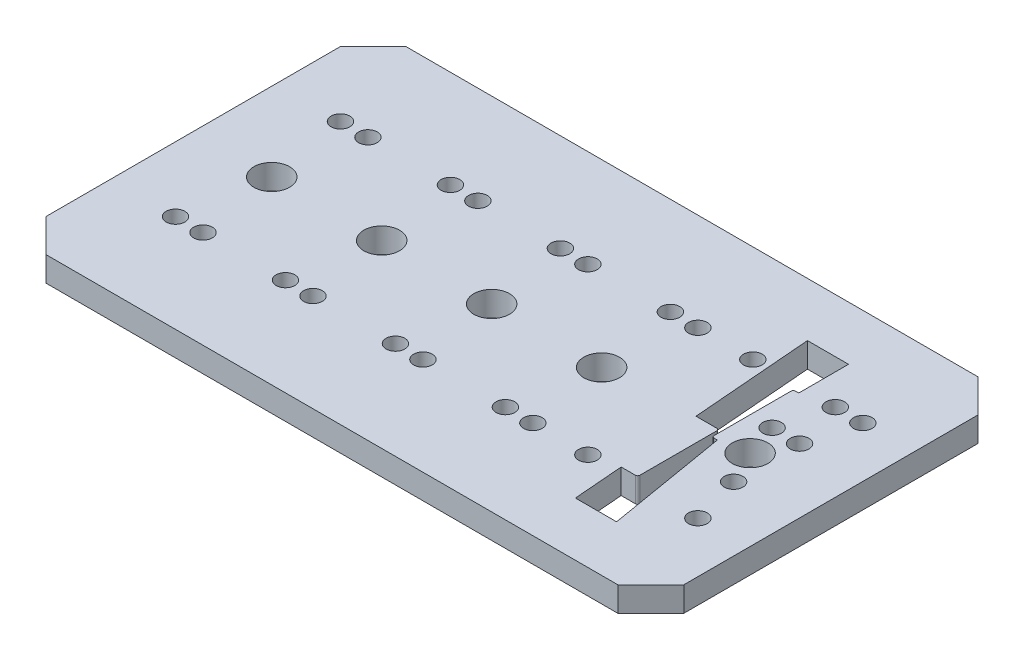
ISO-10303-21;
HEADER;
FILE_DESCRIPTION(('STEP AP214'),'2;1');
FILE_NAME('part.step','',(''),(''),'','','');
FILE_SCHEMA(('AUTOMOTIVE_DESIGN { 1 0 10303 214 1 1 1 1 }'));
ENDSEC;
DATA;
#1=APPLICATION_CONTEXT('core data for automotive mechanical design processes');
#2=APPLICATION_PROTOCOL_DEFINITION('international standard','automotive_design',2000,#1);
#3=PRODUCT_CONTEXT('',#1,'mechanical');
#4=PRODUCT('Part','Part','',(#3));
#5=PRODUCT_RELATED_PRODUCT_CATEGORY('part','',(#4));
#6=PRODUCT_DEFINITION_FORMATION('','',#4);
#7=PRODUCT_DEFINITION_CONTEXT('part definition',#1,'design');
#8=PRODUCT_DEFINITION('design','',#6,#7);
#9=PRODUCT_DEFINITION_SHAPE('','',#8);
#10=(LENGTH_UNIT() NAMED_UNIT(*) SI_UNIT(.MILLI.,.METRE.));
#11=(NAMED_UNIT(*) PLANE_ANGLE_UNIT() SI_UNIT($,.RADIAN.));
#12=(NAMED_UNIT(*) SI_UNIT($,.STERADIAN.) SOLID_ANGLE_UNIT());
#13=UNCERTAINTY_MEASURE_WITH_UNIT(LENGTH_MEASURE(1.E-05),#10,'distance_accuracy_value','');
#14=(GEOMETRIC_REPRESENTATION_CONTEXT(3) GLOBAL_UNCERTAINTY_ASSIGNED_CONTEXT((#13)) GLOBAL_UNIT_ASSIGNED_CONTEXT((#10,
#11,#12)) REPRESENTATION_CONTEXT('',''));
#15=CARTESIAN_POINT('',(0.,0.,0.));
#16=DIRECTION('',(0.,0.,1.));
#17=DIRECTION('',(1.,0.,0.));
#18=AXIS2_PLACEMENT_3D('',#15,#16,#17);
#19=CARTESIAN_POINT('',(0.,4.5,0.));
#20=DIRECTION('',(0.,1.,0.));
#21=DIRECTION('',(0.,0.,1.));
#22=AXIS2_PLACEMENT_3D('',#19,#20,#21);
#23=PLANE('',#22);
#24=CARTESIAN_POINT('',(51.3,4.5,-6.00000000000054));
#25=DIRECTION('',(0.,1.,0.));
#26=DIRECTION('',(0.,0.,1.));
#27=AXIS2_PLACEMENT_3D('',#24,#25,#26);
#28=CIRCLE('',#27,1.7);
#29=CARTESIAN_POINT('',(51.3,4.5,-4.30000000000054));
#30=VERTEX_POINT('',#29);
#31=EDGE_CURVE('E625',#30,#30,#28,.T.);
#32=ORIENTED_EDGE('',*,*,#31,.F.);
#33=EDGE_LOOP('',(#32));
#34=FACE_BOUND('',#33,.T.);
#35=CARTESIAN_POINT('',(21.3,4.5,0.));
#36=DIRECTION('',(0.,1.,0.));
#37=DIRECTION('',(0.,0.,1.));
#38=AXIS2_PLACEMENT_3D('',#35,#36,#37);
#39=CIRCLE('',#38,3.25);
#40=CARTESIAN_POINT('',(21.3,4.5,3.25));
#41=VERTEX_POINT('',#40);
#42=EDGE_CURVE('E637',#41,#41,#39,.T.);
#43=ORIENTED_EDGE('',*,*,#42,.F.);
#44=EDGE_LOOP('',(#43));
#45=FACE_BOUND('',#44,.T.);
#46=CARTESIAN_POINT('',(-41.2,4.5,14.9999999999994));
#47=DIRECTION('',(0.,1.,0.));
#48=DIRECTION('',(0.,0.,-1.));
#49=AXIS2_PLACEMENT_3D('',#46,#47,#48);
#50=CIRCLE('',#49,1.7);
#51=CARTESIAN_POINT('',(-41.2,4.5,13.2999999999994));
#52=VERTEX_POINT('',#51);
#53=EDGE_CURVE('E649',#52,#52,#50,.T.);
#54=ORIENTED_EDGE('',*,*,#53,.F.);
#55=EDGE_LOOP('',(#54));
#56=FACE_BOUND('',#55,.T.);
#57=CARTESIAN_POINT('',(-36.2,4.5,14.9999999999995));
#58=DIRECTION('',(0.,1.,0.));
#59=DIRECTION('',(0.,0.,-1.));
#60=AXIS2_PLACEMENT_3D('',#57,#58,#59);
#61=CIRCLE('',#60,1.7);
#62=CARTESIAN_POINT('',(-36.2,4.5,13.2999999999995));
#63=VERTEX_POINT('',#62);
#64=EDGE_CURVE('E661',#63,#63,#61,.T.);
#65=ORIENTED_EDGE('',*,*,#64,.F.);
#66=EDGE_LOOP('',(#65));
#67=FACE_BOUND('',#66,.T.);
#68=CARTESIAN_POINT('',(-1.19999999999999,4.5,14.9999999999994));
#69=DIRECTION('',(0.,1.,0.));
#70=DIRECTION('',(0.,0.,-1.));
#71=AXIS2_PLACEMENT_3D('',#68,#69,#70);
#72=CIRCLE('',#71,1.7);
#73=CARTESIAN_POINT('',(-1.19999999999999,4.5,13.2999999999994));
#74=VERTEX_POINT('',#73);
#75=EDGE_CURVE('E673',#74,#74,#72,.T.);
#76=ORIENTED_EDGE('',*,*,#75,.F.);
#77=EDGE_LOOP('',(#76));
#78=FACE_BOUND('',#77,.T.);
#79=CARTESIAN_POINT('',(18.8,4.5,14.9999999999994));
#80=DIRECTION('',(0.,1.,0.));
#81=DIRECTION('',(0.,0.,-1.));
#82=AXIS2_PLACEMENT_3D('',#79,#80,#81);
#83=CIRCLE('',#82,1.7);
#84=CARTESIAN_POINT('',(18.8,4.5,13.2999999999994));
#85=VERTEX_POINT('',#84);
#86=EDGE_CURVE('E685',#85,#85,#83,.T.);
#87=ORIENTED_EDGE('',*,*,#86,.F.);
#88=EDGE_LOOP('',(#87));
#89=FACE_BOUND('',#88,.T.);
#90=CARTESIAN_POINT('',(53.8,4.5,14.9999999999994));
#91=DIRECTION('',(0.,1.,0.));
#92=DIRECTION('',(0.,0.,-1.));
#93=AXIS2_PLACEMENT_3D('',#90,#91,#92);
#94=CIRCLE('',#93,1.7);
#95=CARTESIAN_POINT('',(53.8,4.5,13.2999999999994));
#96=VERTEX_POINT('',#95);
#97=EDGE_CURVE('E697',#96,#96,#94,.T.);
#98=ORIENTED_EDGE('',*,*,#97,.F.);
#99=EDGE_LOOP('',(#98));
#100=FACE_BOUND('',#99,.T.);
#101=CARTESIAN_POINT('',(33.8,4.5,14.9999999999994));
#102=DIRECTION('',(0.,1.,0.));
#103=DIRECTION('',(0.,0.,-1.));
#104=AXIS2_PLACEMENT_3D('',#101,#102,#103);
#105=CIRCLE('',#104,1.7);
#106=CARTESIAN_POINT('',(33.8,4.5,13.2999999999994));
#107=VERTEX_POINT('',#106);
#108=EDGE_CURVE('E709',#107,#107,#105,.T.);
#109=ORIENTED_EDGE('',*,*,#108,.F.);
#110=EDGE_LOOP('',(#109));
#111=FACE_BOUND('',#110,.T.);
#112=CARTESIAN_POINT('',(33.8,4.5,-14.9999999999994));
#113=DIRECTION('',(0.,1.,0.));
#114=DIRECTION('',(0.,0.,1.));
#115=AXIS2_PLACEMENT_3D('',#112,#113,#114);
#116=CIRCLE('',#115,1.7);
#117=CARTESIAN_POINT('',(33.8,4.5,-13.2999999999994));
#118=VERTEX_POINT('',#117);
#119=EDGE_CURVE('E721',#118,#118,#116,.T.);
#120=ORIENTED_EDGE('',*,*,#119,.F.);
#121=EDGE_LOOP('',(#120));
#122=FACE_BOUND('',#121,.T.);
#123=CARTESIAN_POINT('',(23.8,4.5,-14.9999999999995));
#124=DIRECTION('',(0.,1.,0.));
#125=DIRECTION('',(0.,0.,1.));
#126=AXIS2_PLACEMENT_3D('',#123,#124,#125);
#127=CIRCLE('',#126,1.7);
#128=CARTESIAN_POINT('',(23.8,4.5,-13.2999999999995));
#129=VERTEX_POINT('',#128);
#130=EDGE_CURVE('E733',#129,#129,#127,.T.);
#131=ORIENTED_EDGE('',*,*,#130,.F.);
#132=EDGE_LOOP('',(#131));
#133=FACE_BOUND('',#132,.T.);
#134=CARTESIAN_POINT('',(-36.2,4.5,-14.9999999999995));
#135=DIRECTION('',(0.,1.,0.));
#136=DIRECTION('',(0.,0.,1.));
#137=AXIS2_PLACEMENT_3D('',#134,#135,#136);
#138=CIRCLE('',#137,1.7);
#139=CARTESIAN_POINT('',(-36.2,4.5,-13.2999999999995));
#140=VERTEX_POINT('',#139);
#141=EDGE_CURVE('E745',#140,#140,#138,.T.);
#142=ORIENTED_EDGE('',*,*,#141,.F.);
#143=EDGE_LOOP('',(#142));
#144=FACE_BOUND('',#143,.T.);
#145=CARTESIAN_POINT('',(-1.19999999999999,4.5,-14.9999999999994));
#146=DIRECTION('',(0.,1.,0.));
#147=DIRECTION('',(0.,0.,1.));
#148=AXIS2_PLACEMENT_3D('',#145,#146,#147);
#149=CIRCLE('',#148,1.7);
#150=CARTESIAN_POINT('',(-1.19999999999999,4.5,-13.2999999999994));
#151=VERTEX_POINT('',#150);
#152=EDGE_CURVE('E757',#151,#151,#149,.T.);
#153=ORIENTED_EDGE('',*,*,#152,.F.);
#154=EDGE_LOOP('',(#153));
#155=FACE_BOUND('',#154,.T.);
#156=CARTESIAN_POINT('',(-16.2,4.5,-14.9999999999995));
#157=DIRECTION('',(0.,1.,0.));
#158=DIRECTION('',(0.,0.,1.));
#159=AXIS2_PLACEMENT_3D('',#156,#157,#158);
#160=CIRCLE('',#159,1.7);
#161=CARTESIAN_POINT('',(-16.2,4.5,-13.2999999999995));
#162=VERTEX_POINT('',#161);
#163=EDGE_CURVE('E769',#162,#162,#160,.T.);
#164=ORIENTED_EDGE('',*,*,#163,.F.);
#165=EDGE_LOOP('',(#164));
#166=FACE_BOUND('',#165,.T.);
#167=CARTESIAN_POINT('',(48.3,4.5,0.));
#168=DIRECTION('',(0.,1.,0.));
#169=DIRECTION('',(0.,0.,1.));
#170=AXIS2_PLACEMENT_3D('',#167,#168,#169);
#171=CIRCLE('',#170,3.25);
#172=CARTESIAN_POINT('',(48.3,4.5,3.24999999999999));
#173=VERTEX_POINT('',#172);
#174=EDGE_CURVE('E781',#173,#173,#171,.T.);
#175=ORIENTED_EDGE('',*,*,#174,.F.);
#176=EDGE_LOOP('',(#175));
#177=FACE_BOUND('',#176,.T.);
#178=DIRECTION('',(-0.166195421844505,0.,-0.986092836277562));
#179=VECTOR('',#178,1.);
#180=CARTESIAN_POINT('',(43.25,4.5,0.899999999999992));
#181=LINE('',#180,#179);
#182=CARTESIAN_POINT('',(46.9662921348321,4.5,22.9500000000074));
#183=VERTEX_POINT('',#182);
#184=CARTESIAN_POINT('',(43.25,4.5,0.899999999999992));
#185=VERTEX_POINT('',#184);
#186=EDGE_CURVE('E202',#183,#185,#181,.T.);
#187=ORIENTED_EDGE('',*,*,#186,.F.);
#188=DIRECTION('',(1.,0.,0.));
#189=VECTOR('',#188,1.);
#190=CARTESIAN_POINT('',(46.9662921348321,4.5,22.9500000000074));
#191=LINE('',#190,#189);
#192=CARTESIAN_POINT('',(39.4842462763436,4.5,22.9500000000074));
#193=VERTEX_POINT('',#192);
#194=EDGE_CURVE('E194',#193,#183,#191,.T.);
#195=ORIENTED_EDGE('',*,*,#194,.F.);
#196=DIRECTION('',(0.0803714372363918,0.,0.996764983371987));
#197=VECTOR('',#196,1.);
#198=CARTESIAN_POINT('',(39.4842462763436,4.5,22.9500000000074));
#199=LINE('',#198,#197);
#200=CARTESIAN_POINT('',(38.7545241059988,4.5,13.9));
#201=VERTEX_POINT('',#200);
#202=EDGE_CURVE('E245',#201,#193,#199,.T.);
#203=ORIENTED_EDGE('',*,*,#202,.F.);
#204=DIRECTION('',(-1.,0.,0.));
#205=VECTOR('',#204,1.);
#206=CARTESIAN_POINT('',(38.7545241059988,4.5,13.9));
#207=LINE('',#206,#205);
#208=CARTESIAN_POINT('',(41.35,4.5,13.9));
#209=VERTEX_POINT('',#208);
#210=EDGE_CURVE('E243',#209,#201,#207,.T.);
#211=ORIENTED_EDGE('',*,*,#210,.F.);
#212=CARTESIAN_POINT('',(41.35,4.5,13.5));
#213=DIRECTION('',(0.,-1.,0.));
#214=DIRECTION('',(0.,0.,-1.));
#215=AXIS2_PLACEMENT_3D('',#212,#213,#214);
#216=CIRCLE('',#215,0.399999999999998);
#217=CARTESIAN_POINT('',(41.75,4.5,13.5));
#218=VERTEX_POINT('',#217);
#219=EDGE_CURVE('E241',#218,#209,#216,.T.);
#220=ORIENTED_EDGE('',*,*,#219,.F.);
#221=DIRECTION('',(0.,0.,1.));
#222=VECTOR('',#221,1.);
#223=CARTESIAN_POINT('',(41.75,4.5,13.5));
#224=LINE('',#223,#222);
#225=CARTESIAN_POINT('',(41.75,4.5,-0.500000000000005));
#226=VERTEX_POINT('',#225);
#227=EDGE_CURVE('E239',#226,#218,#224,.T.);
#228=ORIENTED_EDGE('',*,*,#227,.F.);
#229=CARTESIAN_POINT('',(41.35,4.5,-0.500000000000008));
#230=DIRECTION('',(0.,-1.,0.));
#231=DIRECTION('',(0.,0.,-1.));
#232=AXIS2_PLACEMENT_3D('',#229,#230,#231);
#233=CIRCLE('',#232,0.399999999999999);
#234=CARTESIAN_POINT('',(41.35,4.5,-0.900000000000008));
#235=VERTEX_POINT('',#234);
#236=EDGE_CURVE('E237',#235,#226,#233,.T.);
#237=ORIENTED_EDGE('',*,*,#236,.F.);
#238=DIRECTION('',(1.,0.,0.));
#239=VECTOR('',#238,1.);
#240=CARTESIAN_POINT('',(41.35,4.5,-0.900000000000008));
#241=LINE('',#240,#239);
#242=CARTESIAN_POINT('',(37.5611663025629,4.5,-0.900000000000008));
#243=VERTEX_POINT('',#242);
#244=EDGE_CURVE('E235',#243,#235,#241,.T.);
#245=ORIENTED_EDGE('',*,*,#244,.F.);
#246=DIRECTION('',(0.0803714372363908,0.,0.996764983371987));
#247=VECTOR('',#246,1.);
#248=CARTESIAN_POINT('',(37.5611663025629,4.5,-0.900000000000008));
#249=LINE('',#248,#247);
#250=CARTESIAN_POINT('',(35.7832244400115,4.5,-22.95));
#251=VERTEX_POINT('',#250);
#252=EDGE_CURVE('E233',#251,#243,#249,.T.);
#253=ORIENTED_EDGE('',*,*,#252,.F.);
#254=DIRECTION('',(-1.,0.,0.));
#255=VECTOR('',#254,1.);
#256=CARTESIAN_POINT('',(35.7832244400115,4.5,-22.95));
#257=LINE('',#256,#255);
#258=CARTESIAN_POINT('',(43.25,4.5,-22.95));
#259=VERTEX_POINT('',#258);
#260=EDGE_CURVE('E231',#259,#251,#257,.T.);
#261=ORIENTED_EDGE('',*,*,#260,.F.);
#262=DIRECTION('',(0.,0.,-1.));
#263=VECTOR('',#262,1.);
#264=CARTESIAN_POINT('',(43.25,4.5,-13.9));
#265=LINE('',#264,#263);
#266=CARTESIAN_POINT('',(43.25,4.5,-13.9));
#267=VERTEX_POINT('',#266);
#268=EDGE_CURVE('E229',#267,#259,#265,.T.);
#269=ORIENTED_EDGE('',*,*,#268,.F.);
#270=DIRECTION('',(1.,0.,0.));
#271=VECTOR('',#270,1.);
#272=CARTESIAN_POINT('',(42.65,4.5,-13.9));
#273=LINE('',#272,#271);
#274=CARTESIAN_POINT('',(42.65,4.5,-13.9));
#275=VERTEX_POINT('',#274);
#276=EDGE_CURVE('E227',#275,#267,#273,.T.);
#277=ORIENTED_EDGE('',*,*,#276,.F.);
#278=CARTESIAN_POINT('',(42.65,4.5,-13.5));
#279=DIRECTION('',(0.,-1.,0.));
#280=DIRECTION('',(0.,0.,1.));
#281=AXIS2_PLACEMENT_3D('',#278,#279,#280);
#282=CIRCLE('',#281,0.399999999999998);
#283=CARTESIAN_POINT('',(42.25,4.5,-13.5));
#284=VERTEX_POINT('',#283);
#285=EDGE_CURVE('E225',#284,#275,#282,.T.);
#286=ORIENTED_EDGE('',*,*,#285,.F.);
#287=DIRECTION('',(0.,0.,-1.));
#288=VECTOR('',#287,1.);
#289=CARTESIAN_POINT('',(42.25,4.5,0.499999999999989));
#290=LINE('',#289,#288);
#291=CARTESIAN_POINT('',(42.25,4.5,0.499999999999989));
#292=VERTEX_POINT('',#291);
#293=EDGE_CURVE('E223',#292,#284,#290,.T.);
#294=ORIENTED_EDGE('',*,*,#293,.F.);
#295=CARTESIAN_POINT('',(42.65,4.5,0.499999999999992));
#296=DIRECTION('',(0.,-1.,0.));
#297=DIRECTION('',(0.,0.,-1.));
#298=AXIS2_PLACEMENT_3D('',#295,#296,#297);
#299=CIRCLE('',#298,0.399999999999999);
#300=CARTESIAN_POINT('',(42.65,4.5,0.899999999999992));
#301=VERTEX_POINT('',#300);
#302=EDGE_CURVE('E218',#301,#292,#299,.T.);
#303=ORIENTED_EDGE('',*,*,#302,.F.);
#304=DIRECTION('',(-1.,0.,0.));
#305=VECTOR('',#304,1.);
#306=CARTESIAN_POINT('',(42.65,4.5,0.899999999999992));
#307=LINE('',#306,#305);
#308=EDGE_CURVE('E216',#185,#301,#307,.T.);
#309=ORIENTED_EDGE('',*,*,#308,.F.);
#310=EDGE_LOOP('',(#187,#195,#203,#211,#220,#228,#237,#245,#253,#261,#269,#277,#286,#294,#303,#309));
#311=FACE_BOUND('',#310,.T.);
#312=DIRECTION('',(0.,0.,1.));
#313=VECTOR('',#312,1.);
#314=CARTESIAN_POINT('',(-53.,4.5,-26.75));
#315=LINE('',#314,#313);
#316=CARTESIAN_POINT('',(-53.,4.5,-26.75));
#317=VERTEX_POINT('',#316);
#318=CARTESIAN_POINT('',(-53.,4.5,26.75));
#319=VERTEX_POINT('',#318);
#320=EDGE_CURVE('E318',#317,#319,#315,.T.);
#321=ORIENTED_EDGE('',*,*,#320,.T.);
#322=DIRECTION('',(0.707106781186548,0.,0.707106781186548));
#323=VECTOR('',#322,1.);
#324=CARTESIAN_POINT('',(-53.,4.5,26.75));
#325=LINE('',#324,#323);
#326=CARTESIAN_POINT('',(-47.,4.5,32.75));
#327=VERTEX_POINT('',#326);
#328=EDGE_CURVE('E321',#319,#327,#325,.T.);
#329=ORIENTED_EDGE('',*,*,#328,.T.);
#330=DIRECTION('',(1.,0.,0.));
#331=VECTOR('',#330,1.);
#332=CARTESIAN_POINT('',(-47.,4.5,32.75));
#333=LINE('',#332,#331);
#334=CARTESIAN_POINT('',(57.,4.5,32.75));
#335=VERTEX_POINT('',#334);
#336=EDGE_CURVE('E324',#327,#335,#333,.T.);
#337=ORIENTED_EDGE('',*,*,#336,.T.);
#338=DIRECTION('',(0.707106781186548,0.,-0.707106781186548));
#339=VECTOR('',#338,1.);
#340=CARTESIAN_POINT('',(57.,4.5,32.75));
#341=LINE('',#340,#339);
#342=CARTESIAN_POINT('',(63.,4.5,26.75));
#343=VERTEX_POINT('',#342);
#344=EDGE_CURVE('E326',#335,#343,#341,.T.);
#345=ORIENTED_EDGE('',*,*,#344,.T.);
#346=DIRECTION('',(0.,0.,-1.));
#347=VECTOR('',#346,1.);
#348=CARTESIAN_POINT('',(63.,4.5,26.75));
#349=LINE('',#348,#347);
#350=CARTESIAN_POINT('',(63.,4.5,-26.75));
#351=VERTEX_POINT('',#350);
#352=EDGE_CURVE('E328',#343,#351,#349,.T.);
#353=ORIENTED_EDGE('',*,*,#352,.T.);
#354=DIRECTION('',(-0.707106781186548,0.,-0.707106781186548));
#355=VECTOR('',#354,1.);
#356=CARTESIAN_POINT('',(63.,4.5,-26.75));
#357=LINE('',#356,#355);
#358=CARTESIAN_POINT('',(57.,4.5,-32.75));
#359=VERTEX_POINT('',#358);
#360=EDGE_CURVE('E330',#351,#359,#357,.T.);
#361=ORIENTED_EDGE('',*,*,#360,.T.);
#362=DIRECTION('',(-1.,0.,0.));
#363=VECTOR('',#362,1.);
#364=CARTESIAN_POINT('',(57.,4.5,-32.75));
#365=LINE('',#364,#363);
#366=CARTESIAN_POINT('',(-47.,4.5,-32.75));
#367=VERTEX_POINT('',#366);
#368=EDGE_CURVE('E332',#359,#367,#365,.T.);
#369=ORIENTED_EDGE('',*,*,#368,.T.);
#370=DIRECTION('',(-0.707106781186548,0.,0.707106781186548));
#371=VECTOR('',#370,1.);
#372=CARTESIAN_POINT('',(-47.,4.5,-32.75));
#373=LINE('',#372,#371);
#374=EDGE_CURVE('E334',#367,#317,#373,.T.);
#375=ORIENTED_EDGE('',*,*,#374,.T.);
#376=EDGE_LOOP('',(#321,#329,#337,#345,#353,#361,#369,#375));
#377=FACE_BOUND('',#376,.T.);
#378=CARTESIAN_POINT('',(-38.7,4.5,0.));
#379=DIRECTION('',(0.,1.,0.));
#380=DIRECTION('',(0.,0.,1.));
#381=AXIS2_PLACEMENT_3D('',#378,#379,#380);
#382=CIRCLE('',#381,3.25);
#383=CARTESIAN_POINT('',(-38.7,4.5,3.25));
#384=VERTEX_POINT('',#383);
#385=EDGE_CURVE('E248',#384,#384,#382,.T.);
#386=ORIENTED_EDGE('',*,*,#385,.F.);
#387=EDGE_LOOP('',(#386));
#388=FACE_BOUND('',#387,.T.);
#389=CARTESIAN_POINT('',(-21.2,4.5,-14.9999999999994));
#390=DIRECTION('',(0.,1.,0.));
#391=DIRECTION('',(0.,0.,1.));
#392=AXIS2_PLACEMENT_3D('',#389,#390,#391);
#393=CIRCLE('',#392,1.7);
#394=CARTESIAN_POINT('',(-21.2,4.5,-13.2999999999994));
#395=VERTEX_POINT('',#394);
#396=EDGE_CURVE('E775',#395,#395,#393,.T.);
#397=ORIENTED_EDGE('',*,*,#396,.F.);
#398=EDGE_LOOP('',(#397));
#399=FACE_BOUND('',#398,.T.);
#400=CARTESIAN_POINT('',(-41.2,4.5,-14.9999999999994));
#401=DIRECTION('',(0.,1.,0.));
#402=DIRECTION('',(0.,0.,1.));
#403=AXIS2_PLACEMENT_3D('',#400,#401,#402);
#404=CIRCLE('',#403,1.7);
#405=CARTESIAN_POINT('',(-41.2,4.5,-13.2999999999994));
#406=VERTEX_POINT('',#405);
#407=EDGE_CURVE('E763',#406,#406,#404,.T.);
#408=ORIENTED_EDGE('',*,*,#407,.F.);
#409=EDGE_LOOP('',(#408));
#410=FACE_BOUND('',#409,.T.);
#411=CARTESIAN_POINT('',(3.80000000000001,4.5,-14.9999999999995));
#412=DIRECTION('',(0.,1.,0.));
#413=DIRECTION('',(0.,0.,1.));
#414=AXIS2_PLACEMENT_3D('',#411,#412,#413);
#415=CIRCLE('',#414,1.7);
#416=CARTESIAN_POINT('',(3.80000000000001,4.5,-13.2999999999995));
#417=VERTEX_POINT('',#416);
#418=EDGE_CURVE('E751',#417,#417,#415,.T.);
#419=ORIENTED_EDGE('',*,*,#418,.F.);
#420=EDGE_LOOP('',(#419));
#421=FACE_BOUND('',#420,.T.);
#422=CARTESIAN_POINT('',(18.8,4.5,-14.9999999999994));
#423=DIRECTION('',(0.,1.,0.));
#424=DIRECTION('',(0.,0.,1.));
#425=AXIS2_PLACEMENT_3D('',#422,#423,#424);
#426=CIRCLE('',#425,1.7);
#427=CARTESIAN_POINT('',(18.8,4.5,-13.2999999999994));
#428=VERTEX_POINT('',#427);
#429=EDGE_CURVE('E739',#428,#428,#426,.T.);
#430=ORIENTED_EDGE('',*,*,#429,.F.);
#431=EDGE_LOOP('',(#430));
#432=FACE_BOUND('',#431,.T.);
#433=CARTESIAN_POINT('',(-18.7,4.5,0.));
#434=DIRECTION('',(0.,1.,0.));
#435=DIRECTION('',(0.,0.,1.));
#436=AXIS2_PLACEMENT_3D('',#433,#434,#435);
#437=CIRCLE('',#436,3.25);
#438=CARTESIAN_POINT('',(-18.7,4.5,3.25));
#439=VERTEX_POINT('',#438);
#440=EDGE_CURVE('E727',#439,#439,#437,.T.);
#441=ORIENTED_EDGE('',*,*,#440,.F.);
#442=EDGE_LOOP('',(#441));
#443=FACE_BOUND('',#442,.T.);
#444=CARTESIAN_POINT('',(53.8,4.5,-14.9999999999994));
#445=DIRECTION('',(0.,1.,0.));
#446=DIRECTION('',(0.,0.,1.));
#447=AXIS2_PLACEMENT_3D('',#444,#445,#446);
#448=CIRCLE('',#447,1.7);
#449=CARTESIAN_POINT('',(53.8,4.5,-13.2999999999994));
#450=VERTEX_POINT('',#449);
#451=EDGE_CURVE('E715',#450,#450,#448,.T.);
#452=ORIENTED_EDGE('',*,*,#451,.F.);
#453=EDGE_LOOP('',(#452));
#454=FACE_BOUND('',#453,.T.);
#455=CARTESIAN_POINT('',(48.8,4.5,-14.9999999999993));
#456=DIRECTION('',(0.,1.,0.));
#457=DIRECTION('',(0.,0.,1.));
#458=AXIS2_PLACEMENT_3D('',#455,#456,#457);
#459=CIRCLE('',#458,1.7);
#460=CARTESIAN_POINT('',(48.8,4.5,-13.2999999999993));
#461=VERTEX_POINT('',#460);
#462=EDGE_CURVE('E703',#461,#461,#459,.T.);
#463=ORIENTED_EDGE('',*,*,#462,.F.);
#464=EDGE_LOOP('',(#463));
#465=FACE_BOUND('',#464,.T.);
#466=CARTESIAN_POINT('',(23.8,4.5,14.9999999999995));
#467=DIRECTION('',(0.,1.,0.));
#468=DIRECTION('',(0.,0.,-1.));
#469=AXIS2_PLACEMENT_3D('',#466,#467,#468);
#470=CIRCLE('',#469,1.7);
#471=CARTESIAN_POINT('',(23.8,4.5,13.2999999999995));
#472=VERTEX_POINT('',#471);
#473=EDGE_CURVE('E691',#472,#472,#470,.T.);
#474=ORIENTED_EDGE('',*,*,#473,.F.);
#475=EDGE_LOOP('',(#474));
#476=FACE_BOUND('',#475,.T.);
#477=CARTESIAN_POINT('',(3.80000000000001,4.5,14.9999999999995));
#478=DIRECTION('',(0.,1.,0.));
#479=DIRECTION('',(0.,0.,-1.));
#480=AXIS2_PLACEMENT_3D('',#477,#478,#479);
#481=CIRCLE('',#480,1.7);
#482=CARTESIAN_POINT('',(3.80000000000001,4.5,13.2999999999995));
#483=VERTEX_POINT('',#482);
#484=EDGE_CURVE('E679',#483,#483,#481,.T.);
#485=ORIENTED_EDGE('',*,*,#484,.F.);
#486=EDGE_LOOP('',(#485));
#487=FACE_BOUND('',#486,.T.);
#488=CARTESIAN_POINT('',(-16.2,4.5,14.9999999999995));
#489=DIRECTION('',(0.,1.,0.));
#490=DIRECTION('',(0.,0.,-1.));
#491=AXIS2_PLACEMENT_3D('',#488,#489,#490);
#492=CIRCLE('',#491,1.7);
#493=CARTESIAN_POINT('',(-16.2,4.5,13.2999999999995));
#494=VERTEX_POINT('',#493);
#495=EDGE_CURVE('E667',#494,#494,#492,.T.);
#496=ORIENTED_EDGE('',*,*,#495,.F.);
#497=EDGE_LOOP('',(#496));
#498=FACE_BOUND('',#497,.T.);
#499=CARTESIAN_POINT('',(-21.2,4.5,14.9999999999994));
#500=DIRECTION('',(0.,1.,0.));
#501=DIRECTION('',(0.,0.,-1.));
#502=AXIS2_PLACEMENT_3D('',#499,#500,#501);
#503=CIRCLE('',#502,1.7);
#504=CARTESIAN_POINT('',(-21.2,4.5,13.2999999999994));
#505=VERTEX_POINT('',#504);
#506=EDGE_CURVE('E655',#505,#505,#503,.T.);
#507=ORIENTED_EDGE('',*,*,#506,.F.);
#508=EDGE_LOOP('',(#507));
#509=FACE_BOUND('',#508,.T.);
#510=CARTESIAN_POINT('',(1.30000000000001,4.5,0.));
#511=DIRECTION('',(0.,1.,0.));
#512=DIRECTION('',(0.,0.,1.));
#513=AXIS2_PLACEMENT_3D('',#510,#511,#512);
#514=CIRCLE('',#513,3.25);
#515=CARTESIAN_POINT('',(1.30000000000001,4.5,3.25));
#516=VERTEX_POINT('',#515);
#517=EDGE_CURVE('E643',#516,#516,#514,.T.);
#518=ORIENTED_EDGE('',*,*,#517,.F.);
#519=EDGE_LOOP('',(#518));
#520=FACE_BOUND('',#519,.T.);
#521=CARTESIAN_POINT('',(46.3,4.5,-6.00000000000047));
#522=DIRECTION('',(0.,1.,0.));
#523=DIRECTION('',(0.,0.,1.));
#524=AXIS2_PLACEMENT_3D('',#521,#522,#523);
#525=CIRCLE('',#524,1.7);
#526=CARTESIAN_POINT('',(46.3,4.5,-4.30000000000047));
#527=VERTEX_POINT('',#526);
#528=EDGE_CURVE('E631',#527,#527,#525,.T.);
#529=ORIENTED_EDGE('',*,*,#528,.F.);
#530=EDGE_LOOP('',(#529));
#531=FACE_BOUND('',#530,.T.);
#532=CARTESIAN_POINT('',(51.3,4.5,5.99999999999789));
#533=DIRECTION('',(0.,1.,0.));
#534=DIRECTION('',(0.,0.,1.));
#535=AXIS2_PLACEMENT_3D('',#532,#533,#534);
#536=CIRCLE('',#535,1.7);
#537=CARTESIAN_POINT('',(51.3,4.5,7.69999999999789));
#538=VERTEX_POINT('',#537);
#539=EDGE_CURVE('E616',#538,#538,#536,.T.);
#540=ORIENTED_EDGE('',*,*,#539,.F.);
#541=EDGE_LOOP('',(#540));
#542=FACE_BOUND('',#541,.T.);
#543=ADVANCED_FACE('F33',(#34,#45,#56,#67,#78,#89,#100,#111,#122,#133,#144,#155,#166,#177,#311,
#377,#388,#399,#410,#421,#432,#443,#454,#465,#476,#487,#498,#509,#520,#531,#542),#23,.T.);
#544=CARTESIAN_POINT('',(0.,0.,0.));
#545=DIRECTION('',(0.,1.,0.));
#546=DIRECTION('',(0.,0.,1.));
#547=AXIS2_PLACEMENT_3D('',#544,#545,#546);
#548=PLANE('',#547);
#549=CARTESIAN_POINT('',(51.3,0.,-6.00000000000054));
#550=DIRECTION('',(0.,1.,0.));
#551=DIRECTION('',(0.,0.,1.));
#552=AXIS2_PLACEMENT_3D('',#549,#550,#551);
#553=CIRCLE('',#552,1.7);
#554=CARTESIAN_POINT('',(51.3,0.,-4.30000000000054));
#555=VERTEX_POINT('',#554);
#556=EDGE_CURVE('E622',#555,#555,#553,.T.);
#557=ORIENTED_EDGE('',*,*,#556,.T.);
#558=EDGE_LOOP('',(#557));
#559=FACE_BOUND('',#558,.T.);
#560=CARTESIAN_POINT('',(21.3,0.,0.));
#561=DIRECTION('',(0.,1.,0.));
#562=DIRECTION('',(0.,0.,1.));
#563=AXIS2_PLACEMENT_3D('',#560,#561,#562);
#564=CIRCLE('',#563,3.25);
#565=CARTESIAN_POINT('',(21.3,0.,3.25));
#566=VERTEX_POINT('',#565);
#567=EDGE_CURVE('E634',#566,#566,#564,.T.);
#568=ORIENTED_EDGE('',*,*,#567,.T.);
#569=EDGE_LOOP('',(#568));
#570=FACE_BOUND('',#569,.T.);
#571=CARTESIAN_POINT('',(-41.2,0.,14.9999999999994));
#572=DIRECTION('',(0.,1.,0.));
#573=DIRECTION('',(0.,0.,-1.));
#574=AXIS2_PLACEMENT_3D('',#571,#572,#573);
#575=CIRCLE('',#574,1.7);
#576=CARTESIAN_POINT('',(-41.2,0.,13.2999999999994));
#577=VERTEX_POINT('',#576);
#578=EDGE_CURVE('E646',#577,#577,#575,.T.);
#579=ORIENTED_EDGE('',*,*,#578,.T.);
#580=EDGE_LOOP('',(#579));
#581=FACE_BOUND('',#580,.T.);
#582=CARTESIAN_POINT('',(-36.2,0.,14.9999999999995));
#583=DIRECTION('',(0.,1.,0.));
#584=DIRECTION('',(0.,0.,-1.));
#585=AXIS2_PLACEMENT_3D('',#582,#583,#584);
#586=CIRCLE('',#585,1.7);
#587=CARTESIAN_POINT('',(-36.2,0.,13.2999999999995));
#588=VERTEX_POINT('',#587);
#589=EDGE_CURVE('E658',#588,#588,#586,.T.);
#590=ORIENTED_EDGE('',*,*,#589,.T.);
#591=EDGE_LOOP('',(#590));
#592=FACE_BOUND('',#591,.T.);
#593=CARTESIAN_POINT('',(-1.19999999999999,0.,14.9999999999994));
#594=DIRECTION('',(0.,1.,0.));
#595=DIRECTION('',(0.,0.,-1.));
#596=AXIS2_PLACEMENT_3D('',#593,#594,#595);
#597=CIRCLE('',#596,1.7);
#598=CARTESIAN_POINT('',(-1.19999999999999,0.,13.2999999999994));
#599=VERTEX_POINT('',#598);
#600=EDGE_CURVE('E670',#599,#599,#597,.T.);
#601=ORIENTED_EDGE('',*,*,#600,.T.);
#602=EDGE_LOOP('',(#601));
#603=FACE_BOUND('',#602,.T.);
#604=CARTESIAN_POINT('',(18.8,0.,14.9999999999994));
#605=DIRECTION('',(0.,1.,0.));
#606=DIRECTION('',(0.,0.,-1.));
#607=AXIS2_PLACEMENT_3D('',#604,#605,#606);
#608=CIRCLE('',#607,1.7);
#609=CARTESIAN_POINT('',(18.8,0.,13.2999999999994));
#610=VERTEX_POINT('',#609);
#611=EDGE_CURVE('E682',#610,#610,#608,.T.);
#612=ORIENTED_EDGE('',*,*,#611,.T.);
#613=EDGE_LOOP('',(#612));
#614=FACE_BOUND('',#613,.T.);
#615=CARTESIAN_POINT('',(53.8,0.,14.9999999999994));
#616=DIRECTION('',(0.,1.,0.));
#617=DIRECTION('',(0.,0.,-1.));
#618=AXIS2_PLACEMENT_3D('',#615,#616,#617);
#619=CIRCLE('',#618,1.7);
#620=CARTESIAN_POINT('',(53.8,0.,13.2999999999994));
#621=VERTEX_POINT('',#620);
#622=EDGE_CURVE('E694',#621,#621,#619,.T.);
#623=ORIENTED_EDGE('',*,*,#622,.T.);
#624=EDGE_LOOP('',(#623));
#625=FACE_BOUND('',#624,.T.);
#626=CARTESIAN_POINT('',(33.8,0.,14.9999999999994));
#627=DIRECTION('',(0.,1.,0.));
#628=DIRECTION('',(0.,0.,-1.));
#629=AXIS2_PLACEMENT_3D('',#626,#627,#628);
#630=CIRCLE('',#629,1.7);
#631=CARTESIAN_POINT('',(33.8,0.,13.2999999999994));
#632=VERTEX_POINT('',#631);
#633=EDGE_CURVE('E706',#632,#632,#630,.T.);
#634=ORIENTED_EDGE('',*,*,#633,.T.);
#635=EDGE_LOOP('',(#634));
#636=FACE_BOUND('',#635,.T.);
#637=CARTESIAN_POINT('',(33.8,0.,-14.9999999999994));
#638=DIRECTION('',(0.,1.,0.));
#639=DIRECTION('',(0.,0.,1.));
#640=AXIS2_PLACEMENT_3D('',#637,#638,#639);
#641=CIRCLE('',#640,1.7);
#642=CARTESIAN_POINT('',(33.8,0.,-13.2999999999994));
#643=VERTEX_POINT('',#642);
#644=EDGE_CURVE('E718',#643,#643,#641,.T.);
#645=ORIENTED_EDGE('',*,*,#644,.T.);
#646=EDGE_LOOP('',(#645));
#647=FACE_BOUND('',#646,.T.);
#648=CARTESIAN_POINT('',(23.8,0.,-14.9999999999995));
#649=DIRECTION('',(0.,1.,0.));
#650=DIRECTION('',(0.,0.,1.));
#651=AXIS2_PLACEMENT_3D('',#648,#649,#650);
#652=CIRCLE('',#651,1.7);
#653=CARTESIAN_POINT('',(23.8,0.,-13.2999999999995));
#654=VERTEX_POINT('',#653);
#655=EDGE_CURVE('E730',#654,#654,#652,.T.);
#656=ORIENTED_EDGE('',*,*,#655,.T.);
#657=EDGE_LOOP('',(#656));
#658=FACE_BOUND('',#657,.T.);
#659=CARTESIAN_POINT('',(-36.2,0.,-14.9999999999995));
#660=DIRECTION('',(0.,1.,0.));
#661=DIRECTION('',(0.,0.,1.));
#662=AXIS2_PLACEMENT_3D('',#659,#660,#661);
#663=CIRCLE('',#662,1.7);
#664=CARTESIAN_POINT('',(-36.2,0.,-13.2999999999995));
#665=VERTEX_POINT('',#664);
#666=EDGE_CURVE('E742',#665,#665,#663,.T.);
#667=ORIENTED_EDGE('',*,*,#666,.T.);
#668=EDGE_LOOP('',(#667));
#669=FACE_BOUND('',#668,.T.);
#670=CARTESIAN_POINT('',(-1.19999999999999,0.,-14.9999999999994));
#671=DIRECTION('',(0.,1.,0.));
#672=DIRECTION('',(0.,0.,1.));
#673=AXIS2_PLACEMENT_3D('',#670,#671,#672);
#674=CIRCLE('',#673,1.7);
#675=CARTESIAN_POINT('',(-1.19999999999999,0.,-13.2999999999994));
#676=VERTEX_POINT('',#675);
#677=EDGE_CURVE('E754',#676,#676,#674,.T.);
#678=ORIENTED_EDGE('',*,*,#677,.T.);
#679=EDGE_LOOP('',(#678));
#680=FACE_BOUND('',#679,.T.);
#681=CARTESIAN_POINT('',(-16.2,0.,-14.9999999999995));
#682=DIRECTION('',(0.,1.,0.));
#683=DIRECTION('',(0.,0.,1.));
#684=AXIS2_PLACEMENT_3D('',#681,#682,#683);
#685=CIRCLE('',#684,1.7);
#686=CARTESIAN_POINT('',(-16.2,0.,-13.2999999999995));
#687=VERTEX_POINT('',#686);
#688=EDGE_CURVE('E766',#687,#687,#685,.T.);
#689=ORIENTED_EDGE('',*,*,#688,.T.);
#690=EDGE_LOOP('',(#689));
#691=FACE_BOUND('',#690,.T.);
#692=CARTESIAN_POINT('',(48.3,0.,0.));
#693=DIRECTION('',(0.,1.,0.));
#694=DIRECTION('',(0.,0.,1.));
#695=AXIS2_PLACEMENT_3D('',#692,#693,#694);
#696=CIRCLE('',#695,3.25);
#697=CARTESIAN_POINT('',(48.3,0.,3.24999999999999));
#698=VERTEX_POINT('',#697);
#699=EDGE_CURVE('E778',#698,#698,#696,.T.);
#700=ORIENTED_EDGE('',*,*,#699,.T.);
#701=EDGE_LOOP('',(#700));
#702=FACE_BOUND('',#701,.T.);
#703=DIRECTION('',(1.,0.,0.));
#704=VECTOR('',#703,1.);
#705=CARTESIAN_POINT('',(46.9662921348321,0.,22.9500000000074));
#706=LINE('',#705,#704);
#707=CARTESIAN_POINT('',(39.4842462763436,0.,22.9500000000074));
#708=VERTEX_POINT('',#707);
#709=CARTESIAN_POINT('',(46.9662921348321,0.,22.9500000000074));
#710=VERTEX_POINT('',#709);
#711=EDGE_CURVE('E56',#708,#710,#706,.T.);
#712=ORIENTED_EDGE('',*,*,#711,.T.);
#713=DIRECTION('',(-0.166195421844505,0.,-0.986092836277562));
#714=VECTOR('',#713,1.);
#715=CARTESIAN_POINT('',(43.25,0.,0.899999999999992));
#716=LINE('',#715,#714);
#717=CARTESIAN_POINT('',(43.25,0.,0.899999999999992));
#718=VERTEX_POINT('',#717);
#719=EDGE_CURVE('E209',#710,#718,#716,.T.);
#720=ORIENTED_EDGE('',*,*,#719,.T.);
#721=DIRECTION('',(-1.,0.,0.));
#722=VECTOR('',#721,1.);
#723=CARTESIAN_POINT('',(42.65,0.,0.899999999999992));
#724=LINE('',#723,#722);
#725=CARTESIAN_POINT('',(42.65,0.,0.899999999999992));
#726=VERTEX_POINT('',#725);
#727=EDGE_CURVE('E250',#718,#726,#724,.T.);
#728=ORIENTED_EDGE('',*,*,#727,.T.);
#729=CARTESIAN_POINT('',(42.65,0.,0.499999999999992));
#730=DIRECTION('',(0.,-1.,0.));
#731=DIRECTION('',(0.,0.,-1.));
#732=AXIS2_PLACEMENT_3D('',#729,#730,#731);
#733=CIRCLE('',#732,0.399999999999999);
#734=CARTESIAN_POINT('',(42.25,0.,0.499999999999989));
#735=VERTEX_POINT('',#734);
#736=EDGE_CURVE('E253',#726,#735,#733,.T.);
#737=ORIENTED_EDGE('',*,*,#736,.T.);
#738=DIRECTION('',(0.,0.,-1.));
#739=VECTOR('',#738,1.);
#740=CARTESIAN_POINT('',(42.25,0.,0.499999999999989));
#741=LINE('',#740,#739);
#742=CARTESIAN_POINT('',(42.25,0.,-13.5));
#743=VERTEX_POINT('',#742);
#744=EDGE_CURVE('E256',#735,#743,#741,.T.);
#745=ORIENTED_EDGE('',*,*,#744,.T.);
#746=CARTESIAN_POINT('',(42.65,0.,-13.5));
#747=DIRECTION('',(0.,-1.,0.));
#748=DIRECTION('',(0.,0.,1.));
#749=AXIS2_PLACEMENT_3D('',#746,#747,#748);
#750=CIRCLE('',#749,0.399999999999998);
#751=CARTESIAN_POINT('',(42.65,0.,-13.9));
#752=VERTEX_POINT('',#751);
#753=EDGE_CURVE('E259',#743,#752,#750,.T.);
#754=ORIENTED_EDGE('',*,*,#753,.T.);
#755=DIRECTION('',(1.,0.,0.));
#756=VECTOR('',#755,1.);
#757=CARTESIAN_POINT('',(42.65,0.,-13.9));
#758=LINE('',#757,#756);
#759=CARTESIAN_POINT('',(43.25,0.,-13.9));
#760=VERTEX_POINT('',#759);
#761=EDGE_CURVE('E262',#752,#760,#758,.T.);
#762=ORIENTED_EDGE('',*,*,#761,.T.);
#763=DIRECTION('',(0.,0.,-1.));
#764=VECTOR('',#763,1.);
#765=CARTESIAN_POINT('',(43.25,0.,-13.9));
#766=LINE('',#765,#764);
#767=CARTESIAN_POINT('',(43.25,0.,-22.95));
#768=VERTEX_POINT('',#767);
#769=EDGE_CURVE('E265',#760,#768,#766,.T.);
#770=ORIENTED_EDGE('',*,*,#769,.T.);
#771=DIRECTION('',(-1.,0.,0.));
#772=VECTOR('',#771,1.);
#773=CARTESIAN_POINT('',(35.7832244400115,0.,-22.95));
#774=LINE('',#773,#772);
#775=CARTESIAN_POINT('',(35.7832244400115,0.,-22.95));
#776=VERTEX_POINT('',#775);
#777=EDGE_CURVE('E268',#768,#776,#774,.T.);
#778=ORIENTED_EDGE('',*,*,#777,.T.);
#779=DIRECTION('',(0.0803714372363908,0.,0.996764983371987));
#780=VECTOR('',#779,1.);
#781=CARTESIAN_POINT('',(37.5611663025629,0.,-0.900000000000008));
#782=LINE('',#781,#780);
#783=CARTESIAN_POINT('',(37.5611663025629,0.,-0.900000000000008));
#784=VERTEX_POINT('',#783);
#785=EDGE_CURVE('E271',#776,#784,#782,.T.);
#786=ORIENTED_EDGE('',*,*,#785,.T.);
#787=DIRECTION('',(1.,0.,0.));
#788=VECTOR('',#787,1.);
#789=CARTESIAN_POINT('',(41.35,0.,-0.900000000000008));
#790=LINE('',#789,#788);
#791=CARTESIAN_POINT('',(41.35,0.,-0.900000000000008));
#792=VERTEX_POINT('',#791);
#793=EDGE_CURVE('E274',#784,#792,#790,.T.);
#794=ORIENTED_EDGE('',*,*,#793,.T.);
#795=CARTESIAN_POINT('',(41.35,0.,-0.500000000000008));
#796=DIRECTION('',(0.,-1.,0.));
#797=DIRECTION('',(0.,0.,-1.));
#798=AXIS2_PLACEMENT_3D('',#795,#796,#797);
#799=CIRCLE('',#798,0.399999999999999);
#800=CARTESIAN_POINT('',(41.75,0.,-0.500000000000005));
#801=VERTEX_POINT('',#800);
#802=EDGE_CURVE('E277',#792,#801,#799,.T.);
#803=ORIENTED_EDGE('',*,*,#802,.T.);
#804=DIRECTION('',(0.,0.,1.));
#805=VECTOR('',#804,1.);
#806=CARTESIAN_POINT('',(41.75,0.,13.5));
#807=LINE('',#806,#805);
#808=CARTESIAN_POINT('',(41.75,0.,13.5));
#809=VERTEX_POINT('',#808);
#810=EDGE_CURVE('E280',#801,#809,#807,.T.);
#811=ORIENTED_EDGE('',*,*,#810,.T.);
#812=CARTESIAN_POINT('',(41.35,0.,13.5));
#813=DIRECTION('',(0.,-1.,0.));
#814=DIRECTION('',(0.,0.,-1.));
#815=AXIS2_PLACEMENT_3D('',#812,#813,#814);
#816=CIRCLE('',#815,0.399999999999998);
#817=CARTESIAN_POINT('',(41.35,0.,13.9));
#818=VERTEX_POINT('',#817);
#819=EDGE_CURVE('E283',#809,#818,#816,.T.);
#820=ORIENTED_EDGE('',*,*,#819,.T.);
#821=DIRECTION('',(-1.,0.,0.));
#822=VECTOR('',#821,1.);
#823=CARTESIAN_POINT('',(38.7545241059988,0.,13.9));
#824=LINE('',#823,#822);
#825=CARTESIAN_POINT('',(38.7545241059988,0.,13.9));
#826=VERTEX_POINT('',#825);
#827=EDGE_CURVE('E286',#818,#826,#824,.T.);
#828=ORIENTED_EDGE('',*,*,#827,.T.);
#829=DIRECTION('',(0.0803714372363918,0.,0.996764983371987));
#830=VECTOR('',#829,1.);
#831=CARTESIAN_POINT('',(39.4842462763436,0.,22.9500000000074));
#832=LINE('',#831,#830);
#833=EDGE_CURVE('E203',#826,#708,#832,.T.);
#834=ORIENTED_EDGE('',*,*,#833,.T.);
#835=EDGE_LOOP('',(#712,#720,#728,#737,#745,#754,#762,#770,#778,#786,#794,#803,#811,#820,#828,#834));
#836=FACE_BOUND('',#835,.T.);
#837=DIRECTION('',(0.,0.,1.));
#838=VECTOR('',#837,1.);
#839=CARTESIAN_POINT('',(-53.,0.,-26.75));
#840=LINE('',#839,#838);
#841=CARTESIAN_POINT('',(-53.,0.,-26.75));
#842=VERTEX_POINT('',#841);
#843=CARTESIAN_POINT('',(-53.,0.,26.75));
#844=VERTEX_POINT('',#843);
#845=EDGE_CURVE('E210',#842,#844,#840,.T.);
#846=ORIENTED_EDGE('',*,*,#845,.F.);
#847=DIRECTION('',(-0.707106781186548,0.,0.707106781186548));
#848=VECTOR('',#847,1.);
#849=CARTESIAN_POINT('',(-47.,0.,-32.75));
#850=LINE('',#849,#848);
#851=CARTESIAN_POINT('',(-47.,0.,-32.75));
#852=VERTEX_POINT('',#851);
#853=EDGE_CURVE('E322',#852,#842,#850,.T.);
#854=ORIENTED_EDGE('',*,*,#853,.F.);
#855=DIRECTION('',(-1.,0.,0.));
#856=VECTOR('',#855,1.);
#857=CARTESIAN_POINT('',(57.,0.,-32.75));
#858=LINE('',#857,#856);
#859=CARTESIAN_POINT('',(57.,0.,-32.75));
#860=VERTEX_POINT('',#859);
#861=EDGE_CURVE('E349',#860,#852,#858,.T.);
#862=ORIENTED_EDGE('',*,*,#861,.F.);
#863=DIRECTION('',(-0.707106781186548,0.,-0.707106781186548));
#864=VECTOR('',#863,1.);
#865=CARTESIAN_POINT('',(63.,0.,-26.75));
#866=LINE('',#865,#864);
#867=CARTESIAN_POINT('',(63.,0.,-26.75));
#868=VERTEX_POINT('',#867);
#869=EDGE_CURVE('E347',#868,#860,#866,.T.);
#870=ORIENTED_EDGE('',*,*,#869,.F.);
#871=DIRECTION('',(0.,0.,-1.));
#872=VECTOR('',#871,1.);
#873=CARTESIAN_POINT('',(63.,0.,26.75));
#874=LINE('',#873,#872);
#875=CARTESIAN_POINT('',(63.,0.,26.75));
#876=VERTEX_POINT('',#875);
#877=EDGE_CURVE('E345',#876,#868,#874,.T.);
#878=ORIENTED_EDGE('',*,*,#877,.F.);
#879=DIRECTION('',(0.707106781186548,0.,-0.707106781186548));
#880=VECTOR('',#879,1.);
#881=CARTESIAN_POINT('',(57.,0.,32.75));
#882=LINE('',#881,#880);
#883=CARTESIAN_POINT('',(57.,0.,32.75));
#884=VERTEX_POINT('',#883);
#885=EDGE_CURVE('E343',#884,#876,#882,.T.);
#886=ORIENTED_EDGE('',*,*,#885,.F.);
#887=DIRECTION('',(1.,0.,0.));
#888=VECTOR('',#887,1.);
#889=CARTESIAN_POINT('',(-47.,0.,32.75));
#890=LINE('',#889,#888);
#891=CARTESIAN_POINT('',(-47.,0.,32.75));
#892=VERTEX_POINT('',#891);
#893=EDGE_CURVE('E341',#892,#884,#890,.T.);
#894=ORIENTED_EDGE('',*,*,#893,.F.);
#895=DIRECTION('',(0.707106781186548,0.,0.707106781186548));
#896=VECTOR('',#895,1.);
#897=CARTESIAN_POINT('',(-53.,0.,26.75));
#898=LINE('',#897,#896);
#899=EDGE_CURVE('E339',#844,#892,#898,.T.);
#900=ORIENTED_EDGE('',*,*,#899,.F.);
#901=EDGE_LOOP('',(#846,#854,#862,#870,#878,#886,#894,#900));
#902=FACE_BOUND('',#901,.T.);
#903=CARTESIAN_POINT('',(-38.7,0.,0.));
#904=DIRECTION('',(0.,1.,0.));
#905=DIRECTION('',(0.,0.,1.));
#906=AXIS2_PLACEMENT_3D('',#903,#904,#905);
#907=CIRCLE('',#906,3.25);
#908=CARTESIAN_POINT('',(-38.7,0.,3.25));
#909=VERTEX_POINT('',#908);
#910=EDGE_CURVE('E784',#909,#909,#907,.T.);
#911=ORIENTED_EDGE('',*,*,#910,.T.);
#912=EDGE_LOOP('',(#911));
#913=FACE_BOUND('',#912,.T.);
#914=CARTESIAN_POINT('',(-21.2,0.,-14.9999999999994));
#915=DIRECTION('',(0.,1.,0.));
#916=DIRECTION('',(0.,0.,1.));
#917=AXIS2_PLACEMENT_3D('',#914,#915,#916);
#918=CIRCLE('',#917,1.7);
#919=CARTESIAN_POINT('',(-21.2,0.,-13.2999999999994));
#920=VERTEX_POINT('',#919);
#921=EDGE_CURVE('E772',#920,#920,#918,.T.);
#922=ORIENTED_EDGE('',*,*,#921,.T.);
#923=EDGE_LOOP('',(#922));
#924=FACE_BOUND('',#923,.T.);
#925=CARTESIAN_POINT('',(-41.2,0.,-14.9999999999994));
#926=DIRECTION('',(0.,1.,0.));
#927=DIRECTION('',(0.,0.,1.));
#928=AXIS2_PLACEMENT_3D('',#925,#926,#927);
#929=CIRCLE('',#928,1.7);
#930=CARTESIAN_POINT('',(-41.2,0.,-13.2999999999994));
#931=VERTEX_POINT('',#930);
#932=EDGE_CURVE('E760',#931,#931,#929,.T.);
#933=ORIENTED_EDGE('',*,*,#932,.T.);
#934=EDGE_LOOP('',(#933));
#935=FACE_BOUND('',#934,.T.);
#936=CARTESIAN_POINT('',(3.80000000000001,0.,-14.9999999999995));
#937=DIRECTION('',(0.,1.,0.));
#938=DIRECTION('',(0.,0.,1.));
#939=AXIS2_PLACEMENT_3D('',#936,#937,#938);
#940=CIRCLE('',#939,1.7);
#941=CARTESIAN_POINT('',(3.80000000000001,0.,-13.2999999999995));
#942=VERTEX_POINT('',#941);
#943=EDGE_CURVE('E748',#942,#942,#940,.T.);
#944=ORIENTED_EDGE('',*,*,#943,.T.);
#945=EDGE_LOOP('',(#944));
#946=FACE_BOUND('',#945,.T.);
#947=CARTESIAN_POINT('',(18.8,0.,-14.9999999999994));
#948=DIRECTION('',(0.,1.,0.));
#949=DIRECTION('',(0.,0.,1.));
#950=AXIS2_PLACEMENT_3D('',#947,#948,#949);
#951=CIRCLE('',#950,1.7);
#952=CARTESIAN_POINT('',(18.8,0.,-13.2999999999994));
#953=VERTEX_POINT('',#952);
#954=EDGE_CURVE('E736',#953,#953,#951,.T.);
#955=ORIENTED_EDGE('',*,*,#954,.T.);
#956=EDGE_LOOP('',(#955));
#957=FACE_BOUND('',#956,.T.);
#958=CARTESIAN_POINT('',(-18.7,0.,0.));
#959=DIRECTION('',(0.,1.,0.));
#960=DIRECTION('',(0.,0.,1.));
#961=AXIS2_PLACEMENT_3D('',#958,#959,#960);
#962=CIRCLE('',#961,3.25);
#963=CARTESIAN_POINT('',(-18.7,0.,3.25));
#964=VERTEX_POINT('',#963);
#965=EDGE_CURVE('E724',#964,#964,#962,.T.);
#966=ORIENTED_EDGE('',*,*,#965,.T.);
#967=EDGE_LOOP('',(#966));
#968=FACE_BOUND('',#967,.T.);
#969=CARTESIAN_POINT('',(53.8,0.,-14.9999999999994));
#970=DIRECTION('',(0.,1.,0.));
#971=DIRECTION('',(0.,0.,1.));
#972=AXIS2_PLACEMENT_3D('',#969,#970,#971);
#973=CIRCLE('',#972,1.7);
#974=CARTESIAN_POINT('',(53.8,0.,-13.2999999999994));
#975=VERTEX_POINT('',#974);
#976=EDGE_CURVE('E712',#975,#975,#973,.T.);
#977=ORIENTED_EDGE('',*,*,#976,.T.);
#978=EDGE_LOOP('',(#977));
#979=FACE_BOUND('',#978,.T.);
#980=CARTESIAN_POINT('',(48.8,0.,-14.9999999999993));
#981=DIRECTION('',(0.,1.,0.));
#982=DIRECTION('',(0.,0.,1.));
#983=AXIS2_PLACEMENT_3D('',#980,#981,#982);
#984=CIRCLE('',#983,1.7);
#985=CARTESIAN_POINT('',(48.8,0.,-13.2999999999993));
#986=VERTEX_POINT('',#985);
#987=EDGE_CURVE('E700',#986,#986,#984,.T.);
#988=ORIENTED_EDGE('',*,*,#987,.T.);
#989=EDGE_LOOP('',(#988));
#990=FACE_BOUND('',#989,.T.);
#991=CARTESIAN_POINT('',(23.8,0.,14.9999999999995));
#992=DIRECTION('',(0.,1.,0.));
#993=DIRECTION('',(0.,0.,-1.));
#994=AXIS2_PLACEMENT_3D('',#991,#992,#993);
#995=CIRCLE('',#994,1.7);
#996=CARTESIAN_POINT('',(23.8,0.,13.2999999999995));
#997=VERTEX_POINT('',#996);
#998=EDGE_CURVE('E688',#997,#997,#995,.T.);
#999=ORIENTED_EDGE('',*,*,#998,.T.);
#1000=EDGE_LOOP('',(#999));
#1001=FACE_BOUND('',#1000,.T.);
#1002=CARTESIAN_POINT('',(3.80000000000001,0.,14.9999999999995));
#1003=DIRECTION('',(0.,1.,0.));
#1004=DIRECTION('',(0.,0.,-1.));
#1005=AXIS2_PLACEMENT_3D('',#1002,#1003,#1004);
#1006=CIRCLE('',#1005,1.7);
#1007=CARTESIAN_POINT('',(3.80000000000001,0.,13.2999999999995));
#1008=VERTEX_POINT('',#1007);
#1009=EDGE_CURVE('E676',#1008,#1008,#1006,.T.);
#1010=ORIENTED_EDGE('',*,*,#1009,.T.);
#1011=EDGE_LOOP('',(#1010));
#1012=FACE_BOUND('',#1011,.T.);
#1013=CARTESIAN_POINT('',(-16.2,0.,14.9999999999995));
#1014=DIRECTION('',(0.,1.,0.));
#1015=DIRECTION('',(0.,0.,-1.));
#1016=AXIS2_PLACEMENT_3D('',#1013,#1014,#1015);
#1017=CIRCLE('',#1016,1.7);
#1018=CARTESIAN_POINT('',(-16.2,0.,13.2999999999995));
#1019=VERTEX_POINT('',#1018);
#1020=EDGE_CURVE('E664',#1019,#1019,#1017,.T.);
#1021=ORIENTED_EDGE('',*,*,#1020,.T.);
#1022=EDGE_LOOP('',(#1021));
#1023=FACE_BOUND('',#1022,.T.);
#1024=CARTESIAN_POINT('',(-21.2,0.,14.9999999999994));
#1025=DIRECTION('',(0.,1.,0.));
#1026=DIRECTION('',(0.,0.,-1.));
#1027=AXIS2_PLACEMENT_3D('',#1024,#1025,#1026);
#1028=CIRCLE('',#1027,1.7);
#1029=CARTESIAN_POINT('',(-21.2,0.,13.2999999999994));
#1030=VERTEX_POINT('',#1029);
#1031=EDGE_CURVE('E652',#1030,#1030,#1028,.T.);
#1032=ORIENTED_EDGE('',*,*,#1031,.T.);
#1033=EDGE_LOOP('',(#1032));
#1034=FACE_BOUND('',#1033,.T.);
#1035=CARTESIAN_POINT('',(1.30000000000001,0.,0.));
#1036=DIRECTION('',(0.,1.,0.));
#1037=DIRECTION('',(0.,0.,1.));
#1038=AXIS2_PLACEMENT_3D('',#1035,#1036,#1037);
#1039=CIRCLE('',#1038,3.25);
#1040=CARTESIAN_POINT('',(1.30000000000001,0.,3.25));
#1041=VERTEX_POINT('',#1040);
#1042=EDGE_CURVE('E640',#1041,#1041,#1039,.T.);
#1043=ORIENTED_EDGE('',*,*,#1042,.T.);
#1044=EDGE_LOOP('',(#1043));
#1045=FACE_BOUND('',#1044,.T.);
#1046=CARTESIAN_POINT('',(46.3,0.,-6.00000000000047));
#1047=DIRECTION('',(0.,1.,0.));
#1048=DIRECTION('',(0.,0.,1.));
#1049=AXIS2_PLACEMENT_3D('',#1046,#1047,#1048);
#1050=CIRCLE('',#1049,1.7);
#1051=CARTESIAN_POINT('',(46.3,0.,-4.30000000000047));
#1052=VERTEX_POINT('',#1051);
#1053=EDGE_CURVE('E628',#1052,#1052,#1050,.T.);
#1054=ORIENTED_EDGE('',*,*,#1053,.T.);
#1055=EDGE_LOOP('',(#1054));
#1056=FACE_BOUND('',#1055,.T.);
#1057=CARTESIAN_POINT('',(51.3,0.,5.99999999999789));
#1058=DIRECTION('',(0.,1.,0.));
#1059=DIRECTION('',(0.,0.,1.));
#1060=AXIS2_PLACEMENT_3D('',#1057,#1058,#1059);
#1061=CIRCLE('',#1060,1.7);
#1062=CARTESIAN_POINT('',(51.3,0.,7.69999999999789));
#1063=VERTEX_POINT('',#1062);
#1064=EDGE_CURVE('E619',#1063,#1063,#1061,.T.);
#1065=ORIENTED_EDGE('',*,*,#1064,.T.);
#1066=EDGE_LOOP('',(#1065));
#1067=FACE_BOUND('',#1066,.T.);
#1068=ADVANCED_FACE('F379',(#559,#570,#581,#592,#603,#614,#625,#636,#647,#658,#669,#680,#691,
#702,#836,#902,#913,#924,#935,#946,#957,#968,#979,#990,#1001,#1012,#1023,#1034,#1045,#1056,
#1067),#548,.F.);
#1069=CARTESIAN_POINT('',(-53.,4.5,-26.75));
#1070=DIRECTION('',(1.,0.,0.));
#1071=DIRECTION('',(0.,0.,-1.));
#1072=AXIS2_PLACEMENT_3D('',#1069,#1070,#1071);
#1073=PLANE('',#1072);
#1074=ORIENTED_EDGE('',*,*,#845,.T.);
#1075=DIRECTION('',(0.,-1.,0.));
#1076=VECTOR('',#1075,1.);
#1077=CARTESIAN_POINT('',(-53.,4.5,26.75));
#1078=LINE('',#1077,#1076);
#1079=EDGE_CURVE('E11',#319,#844,#1078,.T.);
#1080=ORIENTED_EDGE('',*,*,#1079,.F.);
#1081=ORIENTED_EDGE('',*,*,#320,.F.);
#1082=DIRECTION('',(0.,-1.,0.));
#1083=VECTOR('',#1082,1.);
#1084=CARTESIAN_POINT('',(-53.,4.5,-26.75));
#1085=LINE('',#1084,#1083);
#1086=EDGE_CURVE('E336',#317,#842,#1085,.T.);
#1087=ORIENTED_EDGE('',*,*,#1086,.T.);
#1088=EDGE_LOOP('',(#1074,#1080,#1081,#1087));
#1089=FACE_BOUND('',#1088,.T.);
#1090=ADVANCED_FACE('F35',(#1089),#1073,.F.);
#1091=CARTESIAN_POINT('',(-53.,4.5,26.75));
#1092=DIRECTION('',(0.707106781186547,0.,-0.707106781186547));
#1093=DIRECTION('',(-0.707106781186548,0.,-0.707106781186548));
#1094=AXIS2_PLACEMENT_3D('',#1091,#1092,#1093);
#1095=PLANE('',#1094);
#1096=ORIENTED_EDGE('',*,*,#899,.T.);
#1097=DIRECTION('',(0.,-1.,0.));
#1098=VECTOR('',#1097,1.);
#1099=CARTESIAN_POINT('',(-47.,4.5,32.75));
#1100=LINE('',#1099,#1098);
#1101=EDGE_CURVE('E41',#327,#892,#1100,.T.);
#1102=ORIENTED_EDGE('',*,*,#1101,.F.);
#1103=ORIENTED_EDGE('',*,*,#328,.F.);
#1104=ORIENTED_EDGE('',*,*,#1079,.T.);
#1105=EDGE_LOOP('',(#1096,#1102,#1103,#1104));
#1106=FACE_BOUND('',#1105,.T.);
#1107=ADVANCED_FACE('F396',(#1106),#1095,.F.);
#1108=CARTESIAN_POINT('',(-47.,4.5,32.75));
#1109=DIRECTION('',(0.,0.,-1.));
#1110=DIRECTION('',(-1.,0.,0.));
#1111=AXIS2_PLACEMENT_3D('',#1108,#1109,#1110);
#1112=PLANE('',#1111);
#1113=ORIENTED_EDGE('',*,*,#893,.T.);
#1114=DIRECTION('',(0.,-1.,0.));
#1115=VECTOR('',#1114,1.);
#1116=CARTESIAN_POINT('',(57.,4.5,32.75));
#1117=LINE('',#1116,#1115);
#1118=EDGE_CURVE('E366',#335,#884,#1117,.T.);
#1119=ORIENTED_EDGE('',*,*,#1118,.F.);
#1120=ORIENTED_EDGE('',*,*,#336,.F.);
#1121=ORIENTED_EDGE('',*,*,#1101,.T.);
#1122=EDGE_LOOP('',(#1113,#1119,#1120,#1121));
#1123=FACE_BOUND('',#1122,.T.);
#1124=ADVANCED_FACE('F373',(#1123),#1112,.F.);
#1125=CARTESIAN_POINT('',(57.,4.5,32.75));
#1126=DIRECTION('',(-0.707106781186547,0.,-0.707106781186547));
#1127=DIRECTION('',(-0.707106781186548,0.,0.707106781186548));
#1128=AXIS2_PLACEMENT_3D('',#1125,#1126,#1127);
#1129=PLANE('',#1128);
#1130=ORIENTED_EDGE('',*,*,#885,.T.);
#1131=DIRECTION('',(0.,-1.,0.));
#1132=VECTOR('',#1131,1.);
#1133=CARTESIAN_POINT('',(63.,4.5,26.75));
#1134=LINE('',#1133,#1132);
#1135=EDGE_CURVE('E363',#343,#876,#1134,.T.);
#1136=ORIENTED_EDGE('',*,*,#1135,.F.);
#1137=ORIENTED_EDGE('',*,*,#344,.F.);
#1138=ORIENTED_EDGE('',*,*,#1118,.T.);
#1139=EDGE_LOOP('',(#1130,#1136,#1137,#1138));
#1140=FACE_BOUND('',#1139,.T.);
#1141=ADVANCED_FACE('F385',(#1140),#1129,.F.);
#1142=CARTESIAN_POINT('',(63.,4.5,26.75));
#1143=DIRECTION('',(-1.,0.,0.));
#1144=DIRECTION('',(0.,0.,1.));
#1145=AXIS2_PLACEMENT_3D('',#1142,#1143,#1144);
#1146=PLANE('',#1145);
#1147=ORIENTED_EDGE('',*,*,#877,.T.);
#1148=DIRECTION('',(0.,-1.,0.));
#1149=VECTOR('',#1148,1.);
#1150=CARTESIAN_POINT('',(63.,4.5,-26.75));
#1151=LINE('',#1150,#1149);
#1152=EDGE_CURVE('E360',#351,#868,#1151,.T.);
#1153=ORIENTED_EDGE('',*,*,#1152,.F.);
#1154=ORIENTED_EDGE('',*,*,#352,.F.);
#1155=ORIENTED_EDGE('',*,*,#1135,.T.);
#1156=EDGE_LOOP('',(#1147,#1153,#1154,#1155));
#1157=FACE_BOUND('',#1156,.T.);
#1158=ADVANCED_FACE('F389',(#1157),#1146,.F.);
#1159=CARTESIAN_POINT('',(63.,4.5,-26.75));
#1160=DIRECTION('',(-0.707106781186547,0.,0.707106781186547));
#1161=DIRECTION('',(0.707106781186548,0.,0.707106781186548));
#1162=AXIS2_PLACEMENT_3D('',#1159,#1160,#1161);
#1163=PLANE('',#1162);
#1164=ORIENTED_EDGE('',*,*,#869,.T.);
#1165=DIRECTION('',(0.,-1.,0.));
#1166=VECTOR('',#1165,1.);
#1167=CARTESIAN_POINT('',(57.,4.5,-32.75));
#1168=LINE('',#1167,#1166);
#1169=EDGE_CURVE('E357',#359,#860,#1168,.T.);
#1170=ORIENTED_EDGE('',*,*,#1169,.F.);
#1171=ORIENTED_EDGE('',*,*,#360,.F.);
#1172=ORIENTED_EDGE('',*,*,#1152,.T.);
#1173=EDGE_LOOP('',(#1164,#1170,#1171,#1172));
#1174=FACE_BOUND('',#1173,.T.);
#1175=ADVANCED_FACE('F409',(#1174),#1163,.F.);
#1176=CARTESIAN_POINT('',(57.,4.5,-32.75));
#1177=DIRECTION('',(0.,0.,1.));
#1178=DIRECTION('',(1.,0.,0.));
#1179=AXIS2_PLACEMENT_3D('',#1176,#1177,#1178);
#1180=PLANE('',#1179);
#1181=ORIENTED_EDGE('',*,*,#861,.T.);
#1182=DIRECTION('',(0.,-1.,0.));
#1183=VECTOR('',#1182,1.);
#1184=CARTESIAN_POINT('',(-47.,4.5,-32.75));
#1185=LINE('',#1184,#1183);
#1186=EDGE_CURVE('E354',#367,#852,#1185,.T.);
#1187=ORIENTED_EDGE('',*,*,#1186,.F.);
#1188=ORIENTED_EDGE('',*,*,#368,.F.);
#1189=ORIENTED_EDGE('',*,*,#1169,.T.);
#1190=EDGE_LOOP('',(#1181,#1187,#1188,#1189));
#1191=FACE_BOUND('',#1190,.T.);
#1192=ADVANCED_FACE('F407',(#1191),#1180,.F.);
#1193=CARTESIAN_POINT('',(-47.,4.5,-32.75));
#1194=DIRECTION('',(0.707106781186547,0.,0.707106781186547));
#1195=DIRECTION('',(0.707106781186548,0.,-0.707106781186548));
#1196=AXIS2_PLACEMENT_3D('',#1193,#1194,#1195);
#1197=PLANE('',#1196);
#1198=ORIENTED_EDGE('',*,*,#853,.T.);
#1199=ORIENTED_EDGE('',*,*,#1086,.F.);
#1200=ORIENTED_EDGE('',*,*,#374,.F.);
#1201=ORIENTED_EDGE('',*,*,#1186,.T.);
#1202=EDGE_LOOP('',(#1198,#1199,#1200,#1201));
#1203=FACE_BOUND('',#1202,.T.);
#1204=ADVANCED_FACE('F402',(#1203),#1197,.F.);
#1205=CARTESIAN_POINT('',(46.9662921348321,4.5,22.9500000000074));
#1206=DIRECTION('',(0.,0.,-1.));
#1207=DIRECTION('',(-1.,0.,0.));
#1208=AXIS2_PLACEMENT_3D('',#1205,#1206,#1207);
#1209=PLANE('',#1208);
#1210=ORIENTED_EDGE('',*,*,#711,.F.);
#1211=DIRECTION('',(0.,-1.,0.));
#1212=VECTOR('',#1211,1.);
#1213=CARTESIAN_POINT('',(39.4842462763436,4.5,22.9500000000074));
#1214=LINE('',#1213,#1212);
#1215=EDGE_CURVE('E198',#193,#708,#1214,.T.);
#1216=ORIENTED_EDGE('',*,*,#1215,.F.);
#1217=ORIENTED_EDGE('',*,*,#194,.T.);
#1218=DIRECTION('',(0.,-1.,0.));
#1219=VECTOR('',#1218,1.);
#1220=CARTESIAN_POINT('',(46.9662921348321,4.5,22.9500000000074));
#1221=LINE('',#1220,#1219);
#1222=EDGE_CURVE('E197',#183,#710,#1221,.T.);
#1223=ORIENTED_EDGE('',*,*,#1222,.T.);
#1224=EDGE_LOOP('',(#1210,#1216,#1217,#1223));
#1225=FACE_BOUND('',#1224,.T.);
#1226=ADVANCED_FACE('F196',(#1225),#1209,.T.);
#1227=CARTESIAN_POINT('',(43.25,4.5,0.899999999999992));
#1228=DIRECTION('',(-0.986092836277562,0.,0.166195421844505));
#1229=DIRECTION('',(0.166195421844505,0.,0.986092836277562));
#1230=AXIS2_PLACEMENT_3D('',#1227,#1228,#1229);
#1231=PLANE('',#1230);
#1232=ORIENTED_EDGE('',*,*,#719,.F.);
#1233=ORIENTED_EDGE('',*,*,#1222,.F.);
#1234=ORIENTED_EDGE('',*,*,#186,.T.);
#1235=DIRECTION('',(0.,-1.,0.));
#1236=VECTOR('',#1235,1.);
#1237=CARTESIAN_POINT('',(43.25,4.5,0.899999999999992));
#1238=LINE('',#1237,#1236);
#1239=EDGE_CURVE('E211',#185,#718,#1238,.T.);
#1240=ORIENTED_EDGE('',*,*,#1239,.T.);
#1241=EDGE_LOOP('',(#1232,#1233,#1234,#1240));
#1242=FACE_BOUND('',#1241,.T.);
#1243=ADVANCED_FACE('F206',(#1242),#1231,.T.);
#1244=CARTESIAN_POINT('',(42.65,4.5,0.899999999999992));
#1245=DIRECTION('',(0.,0.,1.));
#1246=DIRECTION('',(1.,0.,0.));
#1247=AXIS2_PLACEMENT_3D('',#1244,#1245,#1246);
#1248=PLANE('',#1247);
#1249=ORIENTED_EDGE('',*,*,#727,.F.);
#1250=ORIENTED_EDGE('',*,*,#1239,.F.);
#1251=ORIENTED_EDGE('',*,*,#308,.T.);
#1252=DIRECTION('',(0.,-1.,0.));
#1253=VECTOR('',#1252,1.);
#1254=CARTESIAN_POINT('',(42.65,4.5,0.899999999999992));
#1255=LINE('',#1254,#1253);
#1256=EDGE_CURVE('E315',#301,#726,#1255,.T.);
#1257=ORIENTED_EDGE('',*,*,#1256,.T.);
#1258=EDGE_LOOP('',(#1249,#1250,#1251,#1257));
#1259=FACE_BOUND('',#1258,.T.);
#1260=ADVANCED_FACE('F438',(#1259),#1248,.T.);
#1261=CARTESIAN_POINT('',(42.65,4.5,0.499999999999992));
#1262=DIRECTION('',(0.,-1.,0.));
#1263=DIRECTION('',(0.,0.,-1.));
#1264=AXIS2_PLACEMENT_3D('',#1261,#1262,#1263);
#1265=CYLINDRICAL_SURFACE('',#1264,0.399999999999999);
#1266=ORIENTED_EDGE('',*,*,#736,.F.);
#1267=ORIENTED_EDGE('',*,*,#1256,.F.);
#1268=ORIENTED_EDGE('',*,*,#302,.T.);
#1269=DIRECTION('',(0.,-1.,0.));
#1270=VECTOR('',#1269,1.);
#1271=CARTESIAN_POINT('',(42.25,4.5,0.499999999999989));
#1272=LINE('',#1271,#1270);
#1273=EDGE_CURVE('E313',#292,#735,#1272,.T.);
#1274=ORIENTED_EDGE('',*,*,#1273,.T.);
#1275=EDGE_LOOP('',(#1266,#1267,#1268,#1274));
#1276=FACE_BOUND('',#1275,.T.);
#1277=ADVANCED_FACE('F442',(#1276),#1265,.T.);
#1278=CARTESIAN_POINT('',(42.25,4.5,0.499999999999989));
#1279=DIRECTION('',(-1.,0.,0.));
#1280=DIRECTION('',(0.,0.,1.));
#1281=AXIS2_PLACEMENT_3D('',#1278,#1279,#1280);
#1282=PLANE('',#1281);
#1283=ORIENTED_EDGE('',*,*,#744,.F.);
#1284=ORIENTED_EDGE('',*,*,#1273,.F.);
#1285=ORIENTED_EDGE('',*,*,#293,.T.);
#1286=DIRECTION('',(0.,-1.,0.));
#1287=VECTOR('',#1286,1.);
#1288=CARTESIAN_POINT('',(42.25,4.5,-13.5));
#1289=LINE('',#1288,#1287);
#1290=EDGE_CURVE('E311',#284,#743,#1289,.T.);
#1291=ORIENTED_EDGE('',*,*,#1290,.T.);
#1292=EDGE_LOOP('',(#1283,#1284,#1285,#1291));
#1293=FACE_BOUND('',#1292,.T.);
#1294=ADVANCED_FACE('F448',(#1293),#1282,.T.);
#1295=CARTESIAN_POINT('',(42.65,4.5,-13.5));
#1296=DIRECTION('',(0.,-1.,0.));
#1297=DIRECTION('',(0.,0.,-1.));
#1298=AXIS2_PLACEMENT_3D('',#1295,#1296,#1297);
#1299=CYLINDRICAL_SURFACE('',#1298,0.399999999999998);
#1300=ORIENTED_EDGE('',*,*,#753,.F.);
#1301=ORIENTED_EDGE('',*,*,#1290,.F.);
#1302=ORIENTED_EDGE('',*,*,#285,.T.);
#1303=DIRECTION('',(0.,-1.,0.));
#1304=VECTOR('',#1303,1.);
#1305=CARTESIAN_POINT('',(42.65,4.5,-13.9));
#1306=LINE('',#1305,#1304);
#1307=EDGE_CURVE('E309',#275,#752,#1306,.T.);
#1308=ORIENTED_EDGE('',*,*,#1307,.T.);
#1309=EDGE_LOOP('',(#1300,#1301,#1302,#1308));
#1310=FACE_BOUND('',#1309,.T.);
#1311=ADVANCED_FACE('F452',(#1310),#1299,.T.);
#1312=CARTESIAN_POINT('',(42.65,4.5,-13.9));
#1313=DIRECTION('',(0.,0.,-1.));
#1314=DIRECTION('',(-1.,0.,0.));
#1315=AXIS2_PLACEMENT_3D('',#1312,#1313,#1314);
#1316=PLANE('',#1315);
#1317=ORIENTED_EDGE('',*,*,#761,.F.);
#1318=ORIENTED_EDGE('',*,*,#1307,.F.);
#1319=ORIENTED_EDGE('',*,*,#276,.T.);
#1320=DIRECTION('',(0.,-1.,0.));
#1321=VECTOR('',#1320,1.);
#1322=CARTESIAN_POINT('',(43.25,4.5,-13.9));
#1323=LINE('',#1322,#1321);
#1324=EDGE_CURVE('E307',#267,#760,#1323,.T.);
#1325=ORIENTED_EDGE('',*,*,#1324,.T.);
#1326=EDGE_LOOP('',(#1317,#1318,#1319,#1325));
#1327=FACE_BOUND('',#1326,.T.);
#1328=ADVANCED_FACE('F456',(#1327),#1316,.T.);
#1329=CARTESIAN_POINT('',(43.25,4.5,-13.9));
#1330=DIRECTION('',(-1.,0.,0.));
#1331=DIRECTION('',(0.,0.,1.));
#1332=AXIS2_PLACEMENT_3D('',#1329,#1330,#1331);
#1333=PLANE('',#1332);
#1334=ORIENTED_EDGE('',*,*,#769,.F.);
#1335=ORIENTED_EDGE('',*,*,#1324,.F.);
#1336=ORIENTED_EDGE('',*,*,#268,.T.);
#1337=DIRECTION('',(0.,-1.,0.));
#1338=VECTOR('',#1337,1.);
#1339=CARTESIAN_POINT('',(43.25,4.5,-22.95));
#1340=LINE('',#1339,#1338);
#1341=EDGE_CURVE('E305',#259,#768,#1340,.T.);
#1342=ORIENTED_EDGE('',*,*,#1341,.T.);
#1343=EDGE_LOOP('',(#1334,#1335,#1336,#1342));
#1344=FACE_BOUND('',#1343,.T.);
#1345=ADVANCED_FACE('F460',(#1344),#1333,.T.);
#1346=CARTESIAN_POINT('',(35.7832244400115,4.5,-22.95));
#1347=DIRECTION('',(0.,0.,1.));
#1348=DIRECTION('',(1.,0.,0.));
#1349=AXIS2_PLACEMENT_3D('',#1346,#1347,#1348);
#1350=PLANE('',#1349);
#1351=ORIENTED_EDGE('',*,*,#777,.F.);
#1352=ORIENTED_EDGE('',*,*,#1341,.F.);
#1353=ORIENTED_EDGE('',*,*,#260,.T.);
#1354=DIRECTION('',(0.,-1.,0.));
#1355=VECTOR('',#1354,1.);
#1356=CARTESIAN_POINT('',(35.7832244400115,4.5,-22.95));
#1357=LINE('',#1356,#1355);
#1358=EDGE_CURVE('E303',#251,#776,#1357,.T.);
#1359=ORIENTED_EDGE('',*,*,#1358,.T.);
#1360=EDGE_LOOP('',(#1351,#1352,#1353,#1359));
#1361=FACE_BOUND('',#1360,.T.);
#1362=ADVANCED_FACE('F464',(#1361),#1350,.T.);
#1363=CARTESIAN_POINT('',(37.5611663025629,4.5,-0.900000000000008));
#1364=DIRECTION('',(0.996764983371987,0.,-0.0803714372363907));
#1365=DIRECTION('',(-0.0803714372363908,0.,-0.996764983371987));
#1366=AXIS2_PLACEMENT_3D('',#1363,#1364,#1365);
#1367=PLANE('',#1366);
#1368=ORIENTED_EDGE('',*,*,#785,.F.);
#1369=ORIENTED_EDGE('',*,*,#1358,.F.);
#1370=ORIENTED_EDGE('',*,*,#252,.T.);
#1371=DIRECTION('',(0.,-1.,0.));
#1372=VECTOR('',#1371,1.);
#1373=CARTESIAN_POINT('',(37.5611663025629,4.5,-0.900000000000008));
#1374=LINE('',#1373,#1372);
#1375=EDGE_CURVE('E301',#243,#784,#1374,.T.);
#1376=ORIENTED_EDGE('',*,*,#1375,.T.);
#1377=EDGE_LOOP('',(#1368,#1369,#1370,#1376));
#1378=FACE_BOUND('',#1377,.T.);
#1379=ADVANCED_FACE('F468',(#1378),#1367,.T.);
#1380=CARTESIAN_POINT('',(41.35,4.5,-0.900000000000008));
#1381=DIRECTION('',(0.,0.,-1.));
#1382=DIRECTION('',(-1.,0.,0.));
#1383=AXIS2_PLACEMENT_3D('',#1380,#1381,#1382);
#1384=PLANE('',#1383);
#1385=ORIENTED_EDGE('',*,*,#793,.F.);
#1386=ORIENTED_EDGE('',*,*,#1375,.F.);
#1387=ORIENTED_EDGE('',*,*,#244,.T.);
#1388=DIRECTION('',(0.,-1.,0.));
#1389=VECTOR('',#1388,1.);
#1390=CARTESIAN_POINT('',(41.35,4.5,-0.900000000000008));
#1391=LINE('',#1390,#1389);
#1392=EDGE_CURVE('E299',#235,#792,#1391,.T.);
#1393=ORIENTED_EDGE('',*,*,#1392,.T.);
#1394=EDGE_LOOP('',(#1385,#1386,#1387,#1393));
#1395=FACE_BOUND('',#1394,.T.);
#1396=ADVANCED_FACE('F472',(#1395),#1384,.T.);
#1397=CARTESIAN_POINT('',(41.35,4.5,-0.500000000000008));
#1398=DIRECTION('',(0.,-1.,0.));
#1399=DIRECTION('',(0.,0.,-1.));
#1400=AXIS2_PLACEMENT_3D('',#1397,#1398,#1399);
#1401=CYLINDRICAL_SURFACE('',#1400,0.399999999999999);
#1402=ORIENTED_EDGE('',*,*,#802,.F.);
#1403=ORIENTED_EDGE('',*,*,#1392,.F.);
#1404=ORIENTED_EDGE('',*,*,#236,.T.);
#1405=DIRECTION('',(0.,-1.,0.));
#1406=VECTOR('',#1405,1.);
#1407=CARTESIAN_POINT('',(41.75,4.5,-0.500000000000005));
#1408=LINE('',#1407,#1406);
#1409=EDGE_CURVE('E297',#226,#801,#1408,.T.);
#1410=ORIENTED_EDGE('',*,*,#1409,.T.);
#1411=EDGE_LOOP('',(#1402,#1403,#1404,#1410));
#1412=FACE_BOUND('',#1411,.T.);
#1413=ADVANCED_FACE('F476',(#1412),#1401,.T.);
#1414=CARTESIAN_POINT('',(41.75,4.5,13.5));
#1415=DIRECTION('',(1.,0.,0.));
#1416=DIRECTION('',(0.,0.,-1.));
#1417=AXIS2_PLACEMENT_3D('',#1414,#1415,#1416);
#1418=PLANE('',#1417);
#1419=ORIENTED_EDGE('',*,*,#810,.F.);
#1420=ORIENTED_EDGE('',*,*,#1409,.F.);
#1421=ORIENTED_EDGE('',*,*,#227,.T.);
#1422=DIRECTION('',(0.,-1.,0.));
#1423=VECTOR('',#1422,1.);
#1424=CARTESIAN_POINT('',(41.75,4.5,13.5));
#1425=LINE('',#1424,#1423);
#1426=EDGE_CURVE('E295',#218,#809,#1425,.T.);
#1427=ORIENTED_EDGE('',*,*,#1426,.T.);
#1428=EDGE_LOOP('',(#1419,#1420,#1421,#1427));
#1429=FACE_BOUND('',#1428,.T.);
#1430=ADVANCED_FACE('F480',(#1429),#1418,.T.);
#1431=CARTESIAN_POINT('',(41.35,4.5,13.5));
#1432=DIRECTION('',(0.,-1.,0.));
#1433=DIRECTION('',(0.,0.,-1.));
#1434=AXIS2_PLACEMENT_3D('',#1431,#1432,#1433);
#1435=CYLINDRICAL_SURFACE('',#1434,0.399999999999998);
#1436=ORIENTED_EDGE('',*,*,#819,.F.);
#1437=ORIENTED_EDGE('',*,*,#1426,.F.);
#1438=ORIENTED_EDGE('',*,*,#219,.T.);
#1439=DIRECTION('',(0.,-1.,0.));
#1440=VECTOR('',#1439,1.);
#1441=CARTESIAN_POINT('',(41.35,4.5,13.9));
#1442=LINE('',#1441,#1440);
#1443=EDGE_CURVE('E293',#209,#818,#1442,.T.);
#1444=ORIENTED_EDGE('',*,*,#1443,.T.);
#1445=EDGE_LOOP('',(#1436,#1437,#1438,#1444));
#1446=FACE_BOUND('',#1445,.T.);
#1447=ADVANCED_FACE('F484',(#1446),#1435,.T.);
#1448=CARTESIAN_POINT('',(38.7545241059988,4.5,13.9));
#1449=DIRECTION('',(0.,0.,1.));
#1450=DIRECTION('',(1.,0.,0.));
#1451=AXIS2_PLACEMENT_3D('',#1448,#1449,#1450);
#1452=PLANE('',#1451);
#1453=ORIENTED_EDGE('',*,*,#827,.F.);
#1454=ORIENTED_EDGE('',*,*,#1443,.F.);
#1455=ORIENTED_EDGE('',*,*,#210,.T.);
#1456=DIRECTION('',(0.,-1.,0.));
#1457=VECTOR('',#1456,1.);
#1458=CARTESIAN_POINT('',(38.7545241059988,4.5,13.9));
#1459=LINE('',#1458,#1457);
#1460=EDGE_CURVE('E48',#201,#826,#1459,.T.);
#1461=ORIENTED_EDGE('',*,*,#1460,.T.);
#1462=EDGE_LOOP('',(#1453,#1454,#1455,#1461));
#1463=FACE_BOUND('',#1462,.T.);
#1464=ADVANCED_FACE('F488',(#1463),#1452,.T.);
#1465=CARTESIAN_POINT('',(39.4842462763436,4.5,22.9500000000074));
#1466=DIRECTION('',(0.996764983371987,0.,-0.0803714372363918));
#1467=DIRECTION('',(-0.0803714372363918,0.,-0.996764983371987));
#1468=AXIS2_PLACEMENT_3D('',#1465,#1466,#1467);
#1469=PLANE('',#1468);
#1470=ORIENTED_EDGE('',*,*,#833,.F.);
#1471=ORIENTED_EDGE('',*,*,#1460,.F.);
#1472=ORIENTED_EDGE('',*,*,#202,.T.);
#1473=ORIENTED_EDGE('',*,*,#1215,.T.);
#1474=EDGE_LOOP('',(#1470,#1471,#1472,#1473));
#1475=FACE_BOUND('',#1474,.T.);
#1476=ADVANCED_FACE('F492',(#1475),#1469,.T.);
#1477=CARTESIAN_POINT('',(-38.7,4.5,0.));
#1478=DIRECTION('',(0.,-1.,0.));
#1479=DIRECTION('',(0.,0.,-1.));
#1480=AXIS2_PLACEMENT_3D('',#1477,#1478,#1479);
#1481=CYLINDRICAL_SURFACE('',#1480,3.25);
#1482=ORIENTED_EDGE('',*,*,#385,.T.);
#1483=EDGE_LOOP('',(#1482));
#1484=FACE_BOUND('',#1483,.T.);
#1485=ORIENTED_EDGE('',*,*,#910,.F.);
#1486=EDGE_LOOP('',(#1485));
#1487=FACE_BOUND('',#1486,.T.);
#1488=ADVANCED_FACE('F496',(#1484,#1487),#1481,.F.);
#1489=CARTESIAN_POINT('',(48.3,4.5,0.));
#1490=DIRECTION('',(0.,-1.,0.));
#1491=DIRECTION('',(0.,0.,-1.));
#1492=AXIS2_PLACEMENT_3D('',#1489,#1490,#1491);
#1493=CYLINDRICAL_SURFACE('',#1492,3.25);
#1494=ORIENTED_EDGE('',*,*,#174,.T.);
#1495=EDGE_LOOP('',(#1494));
#1496=FACE_BOUND('',#1495,.T.);
#1497=ORIENTED_EDGE('',*,*,#699,.F.);
#1498=EDGE_LOOP('',(#1497));
#1499=FACE_BOUND('',#1498,.T.);
#1500=ADVANCED_FACE('F499',(#1496,#1499),#1493,.F.);
#1501=CARTESIAN_POINT('',(-21.2,4.5,-14.9999999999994));
#1502=DIRECTION('',(0.,-1.,0.));
#1503=DIRECTION('',(0.,0.,-1.));
#1504=AXIS2_PLACEMENT_3D('',#1501,#1502,#1503);
#1505=CYLINDRICAL_SURFACE('',#1504,1.7);
#1506=ORIENTED_EDGE('',*,*,#396,.T.);
#1507=EDGE_LOOP('',(#1506));
#1508=FACE_BOUND('',#1507,.T.);
#1509=ORIENTED_EDGE('',*,*,#921,.F.);
#1510=EDGE_LOOP('',(#1509));
#1511=FACE_BOUND('',#1510,.T.);
#1512=ADVANCED_FACE('F503',(#1508,#1511),#1505,.F.);
#1513=CARTESIAN_POINT('',(-16.2,4.5,-14.9999999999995));
#1514=DIRECTION('',(0.,-1.,0.));
#1515=DIRECTION('',(0.,0.,-1.));
#1516=AXIS2_PLACEMENT_3D('',#1513,#1514,#1515);
#1517=CYLINDRICAL_SURFACE('',#1516,1.7);
#1518=ORIENTED_EDGE('',*,*,#163,.T.);
#1519=EDGE_LOOP('',(#1518));
#1520=FACE_BOUND('',#1519,.T.);
#1521=ORIENTED_EDGE('',*,*,#688,.F.);
#1522=EDGE_LOOP('',(#1521));
#1523=FACE_BOUND('',#1522,.T.);
#1524=ADVANCED_FACE('F507',(#1520,#1523),#1517,.F.);
#1525=CARTESIAN_POINT('',(-41.2,4.5,-14.9999999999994));
#1526=DIRECTION('',(0.,-1.,0.));
#1527=DIRECTION('',(0.,0.,-1.));
#1528=AXIS2_PLACEMENT_3D('',#1525,#1526,#1527);
#1529=CYLINDRICAL_SURFACE('',#1528,1.7);
#1530=ORIENTED_EDGE('',*,*,#407,.T.);
#1531=EDGE_LOOP('',(#1530));
#1532=FACE_BOUND('',#1531,.T.);
#1533=ORIENTED_EDGE('',*,*,#932,.F.);
#1534=EDGE_LOOP('',(#1533));
#1535=FACE_BOUND('',#1534,.T.);
#1536=ADVANCED_FACE('F511',(#1532,#1535),#1529,.F.);
#1537=CARTESIAN_POINT('',(-1.19999999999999,4.5,-14.9999999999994));
#1538=DIRECTION('',(0.,-1.,0.));
#1539=DIRECTION('',(0.,0.,-1.));
#1540=AXIS2_PLACEMENT_3D('',#1537,#1538,#1539);
#1541=CYLINDRICAL_SURFACE('',#1540,1.7);
#1542=ORIENTED_EDGE('',*,*,#152,.T.);
#1543=EDGE_LOOP('',(#1542));
#1544=FACE_BOUND('',#1543,.T.);
#1545=ORIENTED_EDGE('',*,*,#677,.F.);
#1546=EDGE_LOOP('',(#1545));
#1547=FACE_BOUND('',#1546,.T.);
#1548=ADVANCED_FACE('F515',(#1544,#1547),#1541,.F.);
#1549=CARTESIAN_POINT('',(3.80000000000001,4.5,-14.9999999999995));
#1550=DIRECTION('',(0.,-1.,0.));
#1551=DIRECTION('',(0.,0.,-1.));
#1552=AXIS2_PLACEMENT_3D('',#1549,#1550,#1551);
#1553=CYLINDRICAL_SURFACE('',#1552,1.7);
#1554=ORIENTED_EDGE('',*,*,#418,.T.);
#1555=EDGE_LOOP('',(#1554));
#1556=FACE_BOUND('',#1555,.T.);
#1557=ORIENTED_EDGE('',*,*,#943,.F.);
#1558=EDGE_LOOP('',(#1557));
#1559=FACE_BOUND('',#1558,.T.);
#1560=ADVANCED_FACE('F519',(#1556,#1559),#1553,.F.);
#1561=CARTESIAN_POINT('',(-36.2,4.5,-14.9999999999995));
#1562=DIRECTION('',(0.,-1.,0.));
#1563=DIRECTION('',(0.,0.,-1.));
#1564=AXIS2_PLACEMENT_3D('',#1561,#1562,#1563);
#1565=CYLINDRICAL_SURFACE('',#1564,1.7);
#1566=ORIENTED_EDGE('',*,*,#141,.T.);
#1567=EDGE_LOOP('',(#1566));
#1568=FACE_BOUND('',#1567,.T.);
#1569=ORIENTED_EDGE('',*,*,#666,.F.);
#1570=EDGE_LOOP('',(#1569));
#1571=FACE_BOUND('',#1570,.T.);
#1572=ADVANCED_FACE('F523',(#1568,#1571),#1565,.F.);
#1573=CARTESIAN_POINT('',(18.8,4.5,-14.9999999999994));
#1574=DIRECTION('',(0.,-1.,0.));
#1575=DIRECTION('',(0.,0.,-1.));
#1576=AXIS2_PLACEMENT_3D('',#1573,#1574,#1575);
#1577=CYLINDRICAL_SURFACE('',#1576,1.7);
#1578=ORIENTED_EDGE('',*,*,#429,.T.);
#1579=EDGE_LOOP('',(#1578));
#1580=FACE_BOUND('',#1579,.T.);
#1581=ORIENTED_EDGE('',*,*,#954,.F.);
#1582=EDGE_LOOP('',(#1581));
#1583=FACE_BOUND('',#1582,.T.);
#1584=ADVANCED_FACE('F527',(#1580,#1583),#1577,.F.);
#1585=CARTESIAN_POINT('',(23.8,4.5,-14.9999999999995));
#1586=DIRECTION('',(0.,-1.,0.));
#1587=DIRECTION('',(0.,0.,-1.));
#1588=AXIS2_PLACEMENT_3D('',#1585,#1586,#1587);
#1589=CYLINDRICAL_SURFACE('',#1588,1.7);
#1590=ORIENTED_EDGE('',*,*,#130,.T.);
#1591=EDGE_LOOP('',(#1590));
#1592=FACE_BOUND('',#1591,.T.);
#1593=ORIENTED_EDGE('',*,*,#655,.F.);
#1594=EDGE_LOOP('',(#1593));
#1595=FACE_BOUND('',#1594,.T.);
#1596=ADVANCED_FACE('F531',(#1592,#1595),#1589,.F.);
#1597=CARTESIAN_POINT('',(-18.7,4.5,0.));
#1598=DIRECTION('',(0.,-1.,0.));
#1599=DIRECTION('',(0.,0.,-1.));
#1600=AXIS2_PLACEMENT_3D('',#1597,#1598,#1599);
#1601=CYLINDRICAL_SURFACE('',#1600,3.25);
#1602=ORIENTED_EDGE('',*,*,#440,.T.);
#1603=EDGE_LOOP('',(#1602));
#1604=FACE_BOUND('',#1603,.T.);
#1605=ORIENTED_EDGE('',*,*,#965,.F.);
#1606=EDGE_LOOP('',(#1605));
#1607=FACE_BOUND('',#1606,.T.);
#1608=ADVANCED_FACE('F535',(#1604,#1607),#1601,.F.);
#1609=CARTESIAN_POINT('',(33.8,4.5,-14.9999999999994));
#1610=DIRECTION('',(0.,-1.,0.));
#1611=DIRECTION('',(0.,0.,-1.));
#1612=AXIS2_PLACEMENT_3D('',#1609,#1610,#1611);
#1613=CYLINDRICAL_SURFACE('',#1612,1.7);
#1614=ORIENTED_EDGE('',*,*,#119,.T.);
#1615=EDGE_LOOP('',(#1614));
#1616=FACE_BOUND('',#1615,.T.);
#1617=ORIENTED_EDGE('',*,*,#644,.F.);
#1618=EDGE_LOOP('',(#1617));
#1619=FACE_BOUND('',#1618,.T.);
#1620=ADVANCED_FACE('F539',(#1616,#1619),#1613,.F.);
#1621=CARTESIAN_POINT('',(53.8,4.5,-14.9999999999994));
#1622=DIRECTION('',(0.,-1.,0.));
#1623=DIRECTION('',(0.,0.,-1.));
#1624=AXIS2_PLACEMENT_3D('',#1621,#1622,#1623);
#1625=CYLINDRICAL_SURFACE('',#1624,1.7);
#1626=ORIENTED_EDGE('',*,*,#451,.T.);
#1627=EDGE_LOOP('',(#1626));
#1628=FACE_BOUND('',#1627,.T.);
#1629=ORIENTED_EDGE('',*,*,#976,.F.);
#1630=EDGE_LOOP('',(#1629));
#1631=FACE_BOUND('',#1630,.T.);
#1632=ADVANCED_FACE('F543',(#1628,#1631),#1625,.F.);
#1633=CARTESIAN_POINT('',(33.8,4.5,14.9999999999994));
#1634=DIRECTION('',(0.,-1.,0.));
#1635=DIRECTION('',(0.,0.,-1.));
#1636=AXIS2_PLACEMENT_3D('',#1633,#1634,#1635);
#1637=CYLINDRICAL_SURFACE('',#1636,1.7);
#1638=ORIENTED_EDGE('',*,*,#108,.T.);
#1639=EDGE_LOOP('',(#1638));
#1640=FACE_BOUND('',#1639,.T.);
#1641=ORIENTED_EDGE('',*,*,#633,.F.);
#1642=EDGE_LOOP('',(#1641));
#1643=FACE_BOUND('',#1642,.T.);
#1644=ADVANCED_FACE('F547',(#1640,#1643),#1637,.F.);
#1645=CARTESIAN_POINT('',(48.8,4.5,-14.9999999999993));
#1646=DIRECTION('',(0.,-1.,0.));
#1647=DIRECTION('',(0.,0.,-1.));
#1648=AXIS2_PLACEMENT_3D('',#1645,#1646,#1647);
#1649=CYLINDRICAL_SURFACE('',#1648,1.7);
#1650=ORIENTED_EDGE('',*,*,#462,.T.);
#1651=EDGE_LOOP('',(#1650));
#1652=FACE_BOUND('',#1651,.T.);
#1653=ORIENTED_EDGE('',*,*,#987,.F.);
#1654=EDGE_LOOP('',(#1653));
#1655=FACE_BOUND('',#1654,.T.);
#1656=ADVANCED_FACE('F551',(#1652,#1655),#1649,.F.);
#1657=CARTESIAN_POINT('',(53.8,4.5,14.9999999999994));
#1658=DIRECTION('',(0.,-1.,0.));
#1659=DIRECTION('',(0.,0.,-1.));
#1660=AXIS2_PLACEMENT_3D('',#1657,#1658,#1659);
#1661=CYLINDRICAL_SURFACE('',#1660,1.7);
#1662=ORIENTED_EDGE('',*,*,#97,.T.);
#1663=EDGE_LOOP('',(#1662));
#1664=FACE_BOUND('',#1663,.T.);
#1665=ORIENTED_EDGE('',*,*,#622,.F.);
#1666=EDGE_LOOP('',(#1665));
#1667=FACE_BOUND('',#1666,.T.);
#1668=ADVANCED_FACE('F555',(#1664,#1667),#1661,.F.);
#1669=CARTESIAN_POINT('',(23.8,4.5,14.9999999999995));
#1670=DIRECTION('',(0.,-1.,0.));
#1671=DIRECTION('',(0.,0.,-1.));
#1672=AXIS2_PLACEMENT_3D('',#1669,#1670,#1671);
#1673=CYLINDRICAL_SURFACE('',#1672,1.7);
#1674=ORIENTED_EDGE('',*,*,#473,.T.);
#1675=EDGE_LOOP('',(#1674));
#1676=FACE_BOUND('',#1675,.T.);
#1677=ORIENTED_EDGE('',*,*,#998,.F.);
#1678=EDGE_LOOP('',(#1677));
#1679=FACE_BOUND('',#1678,.T.);
#1680=ADVANCED_FACE('F559',(#1676,#1679),#1673,.F.);
#1681=CARTESIAN_POINT('',(18.8,4.5,14.9999999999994));
#1682=DIRECTION('',(0.,-1.,0.));
#1683=DIRECTION('',(0.,0.,-1.));
#1684=AXIS2_PLACEMENT_3D('',#1681,#1682,#1683);
#1685=CYLINDRICAL_SURFACE('',#1684,1.7);
#1686=ORIENTED_EDGE('',*,*,#86,.T.);
#1687=EDGE_LOOP('',(#1686));
#1688=FACE_BOUND('',#1687,.T.);
#1689=ORIENTED_EDGE('',*,*,#611,.F.);
#1690=EDGE_LOOP('',(#1689));
#1691=FACE_BOUND('',#1690,.T.);
#1692=ADVANCED_FACE('F563',(#1688,#1691),#1685,.F.);
#1693=CARTESIAN_POINT('',(3.80000000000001,4.5,14.9999999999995));
#1694=DIRECTION('',(0.,-1.,0.));
#1695=DIRECTION('',(0.,0.,-1.));
#1696=AXIS2_PLACEMENT_3D('',#1693,#1694,#1695);
#1697=CYLINDRICAL_SURFACE('',#1696,1.7);
#1698=ORIENTED_EDGE('',*,*,#484,.T.);
#1699=EDGE_LOOP('',(#1698));
#1700=FACE_BOUND('',#1699,.T.);
#1701=ORIENTED_EDGE('',*,*,#1009,.F.);
#1702=EDGE_LOOP('',(#1701));
#1703=FACE_BOUND('',#1702,.T.);
#1704=ADVANCED_FACE('F567',(#1700,#1703),#1697,.F.);
#1705=CARTESIAN_POINT('',(-1.19999999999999,4.5,14.9999999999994));
#1706=DIRECTION('',(0.,-1.,0.));
#1707=DIRECTION('',(0.,0.,-1.));
#1708=AXIS2_PLACEMENT_3D('',#1705,#1706,#1707);
#1709=CYLINDRICAL_SURFACE('',#1708,1.7);
#1710=ORIENTED_EDGE('',*,*,#75,.T.);
#1711=EDGE_LOOP('',(#1710));
#1712=FACE_BOUND('',#1711,.T.);
#1713=ORIENTED_EDGE('',*,*,#600,.F.);
#1714=EDGE_LOOP('',(#1713));
#1715=FACE_BOUND('',#1714,.T.);
#1716=ADVANCED_FACE('F571',(#1712,#1715),#1709,.F.);
#1717=CARTESIAN_POINT('',(-16.2,4.5,14.9999999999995));
#1718=DIRECTION('',(0.,-1.,0.));
#1719=DIRECTION('',(0.,0.,-1.));
#1720=AXIS2_PLACEMENT_3D('',#1717,#1718,#1719);
#1721=CYLINDRICAL_SURFACE('',#1720,1.7);
#1722=ORIENTED_EDGE('',*,*,#495,.T.);
#1723=EDGE_LOOP('',(#1722));
#1724=FACE_BOUND('',#1723,.T.);
#1725=ORIENTED_EDGE('',*,*,#1020,.F.);
#1726=EDGE_LOOP('',(#1725));
#1727=FACE_BOUND('',#1726,.T.);
#1728=ADVANCED_FACE('F575',(#1724,#1727),#1721,.F.);
#1729=CARTESIAN_POINT('',(-36.2,4.5,14.9999999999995));
#1730=DIRECTION('',(0.,-1.,0.));
#1731=DIRECTION('',(0.,0.,-1.));
#1732=AXIS2_PLACEMENT_3D('',#1729,#1730,#1731);
#1733=CYLINDRICAL_SURFACE('',#1732,1.7);
#1734=ORIENTED_EDGE('',*,*,#64,.T.);
#1735=EDGE_LOOP('',(#1734));
#1736=FACE_BOUND('',#1735,.T.);
#1737=ORIENTED_EDGE('',*,*,#589,.F.);
#1738=EDGE_LOOP('',(#1737));
#1739=FACE_BOUND('',#1738,.T.);
#1740=ADVANCED_FACE('F579',(#1736,#1739),#1733,.F.);
#1741=CARTESIAN_POINT('',(-21.2,4.5,14.9999999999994));
#1742=DIRECTION('',(0.,-1.,0.));
#1743=DIRECTION('',(0.,0.,-1.));
#1744=AXIS2_PLACEMENT_3D('',#1741,#1742,#1743);
#1745=CYLINDRICAL_SURFACE('',#1744,1.7);
#1746=ORIENTED_EDGE('',*,*,#506,.T.);
#1747=EDGE_LOOP('',(#1746));
#1748=FACE_BOUND('',#1747,.T.);
#1749=ORIENTED_EDGE('',*,*,#1031,.F.);
#1750=EDGE_LOOP('',(#1749));
#1751=FACE_BOUND('',#1750,.T.);
#1752=ADVANCED_FACE('F583',(#1748,#1751),#1745,.F.);
#1753=CARTESIAN_POINT('',(-41.2,4.5,14.9999999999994));
#1754=DIRECTION('',(0.,-1.,0.));
#1755=DIRECTION('',(0.,0.,-1.));
#1756=AXIS2_PLACEMENT_3D('',#1753,#1754,#1755);
#1757=CYLINDRICAL_SURFACE('',#1756,1.7);
#1758=ORIENTED_EDGE('',*,*,#53,.T.);
#1759=EDGE_LOOP('',(#1758));
#1760=FACE_BOUND('',#1759,.T.);
#1761=ORIENTED_EDGE('',*,*,#578,.F.);
#1762=EDGE_LOOP('',(#1761));
#1763=FACE_BOUND('',#1762,.T.);
#1764=ADVANCED_FACE('F587',(#1760,#1763),#1757,.F.);
#1765=CARTESIAN_POINT('',(1.30000000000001,4.5,0.));
#1766=DIRECTION('',(0.,-1.,0.));
#1767=DIRECTION('',(0.,0.,-1.));
#1768=AXIS2_PLACEMENT_3D('',#1765,#1766,#1767);
#1769=CYLINDRICAL_SURFACE('',#1768,3.25);
#1770=ORIENTED_EDGE('',*,*,#517,.T.);
#1771=EDGE_LOOP('',(#1770));
#1772=FACE_BOUND('',#1771,.T.);
#1773=ORIENTED_EDGE('',*,*,#1042,.F.);
#1774=EDGE_LOOP('',(#1773));
#1775=FACE_BOUND('',#1774,.T.);
#1776=ADVANCED_FACE('F591',(#1772,#1775),#1769,.F.);
#1777=CARTESIAN_POINT('',(21.3,4.5,0.));
#1778=DIRECTION('',(0.,-1.,0.));
#1779=DIRECTION('',(0.,0.,-1.));
#1780=AXIS2_PLACEMENT_3D('',#1777,#1778,#1779);
#1781=CYLINDRICAL_SURFACE('',#1780,3.25);
#1782=ORIENTED_EDGE('',*,*,#42,.T.);
#1783=EDGE_LOOP('',(#1782));
#1784=FACE_BOUND('',#1783,.T.);
#1785=ORIENTED_EDGE('',*,*,#567,.F.);
#1786=EDGE_LOOP('',(#1785));
#1787=FACE_BOUND('',#1786,.T.);
#1788=ADVANCED_FACE('F595',(#1784,#1787),#1781,.F.);
#1789=CARTESIAN_POINT('',(46.3,4.5,-6.00000000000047));
#1790=DIRECTION('',(0.,-1.,0.));
#1791=DIRECTION('',(0.,0.,-1.));
#1792=AXIS2_PLACEMENT_3D('',#1789,#1790,#1791);
#1793=CYLINDRICAL_SURFACE('',#1792,1.7);
#1794=ORIENTED_EDGE('',*,*,#528,.T.);
#1795=EDGE_LOOP('',(#1794));
#1796=FACE_BOUND('',#1795,.T.);
#1797=ORIENTED_EDGE('',*,*,#1053,.F.);
#1798=EDGE_LOOP('',(#1797));
#1799=FACE_BOUND('',#1798,.T.);
#1800=ADVANCED_FACE('F599',(#1796,#1799),#1793,.F.);
#1801=CARTESIAN_POINT('',(51.3,4.5,-6.00000000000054));
#1802=DIRECTION('',(0.,-1.,0.));
#1803=DIRECTION('',(0.,0.,-1.));
#1804=AXIS2_PLACEMENT_3D('',#1801,#1802,#1803);
#1805=CYLINDRICAL_SURFACE('',#1804,1.7);
#1806=ORIENTED_EDGE('',*,*,#31,.T.);
#1807=EDGE_LOOP('',(#1806));
#1808=FACE_BOUND('',#1807,.T.);
#1809=ORIENTED_EDGE('',*,*,#556,.F.);
#1810=EDGE_LOOP('',(#1809));
#1811=FACE_BOUND('',#1810,.T.);
#1812=ADVANCED_FACE('F603',(#1808,#1811),#1805,.F.);
#1813=CARTESIAN_POINT('',(51.3,4.5,5.99999999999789));
#1814=DIRECTION('',(0.,-1.,0.));
#1815=DIRECTION('',(0.,0.,-1.));
#1816=AXIS2_PLACEMENT_3D('',#1813,#1814,#1815);
#1817=CYLINDRICAL_SURFACE('',#1816,1.7);
#1818=ORIENTED_EDGE('',*,*,#539,.T.);
#1819=EDGE_LOOP('',(#1818));
#1820=FACE_BOUND('',#1819,.T.);
#1821=ORIENTED_EDGE('',*,*,#1064,.F.);
#1822=EDGE_LOOP('',(#1821));
#1823=FACE_BOUND('',#1822,.T.);
#1824=ADVANCED_FACE('F607',(#1820,#1823),#1817,.F.);
#1825=CLOSED_SHELL('',(#543,#1068,#1090,#1107,#1124,#1141,#1158,#1175,#1192,#1204,#1226,#1243,
#1260,#1277,#1294,#1311,#1328,#1345,#1362,#1379,#1396,#1413,#1430,#1447,#1464,#1476,#1488,#1500,
#1512,#1524,#1536,#1548,#1560,#1572,#1584,#1596,#1608,#1620,#1632,#1644,#1656,#1668,#1680,#1692,
#1704,#1716,#1728,#1740,#1752,#1764,#1776,#1788,#1800,#1812,#1824));
#1826=MANIFOLD_SOLID_BREP('B2',#1825);
#1827=ADVANCED_BREP_SHAPE_REPRESENTATION('',(#18,#1826),#14);
#1828=SHAPE_DEFINITION_REPRESENTATION(#9,#1827);
ENDSEC;
END-ISO-10303-21;
